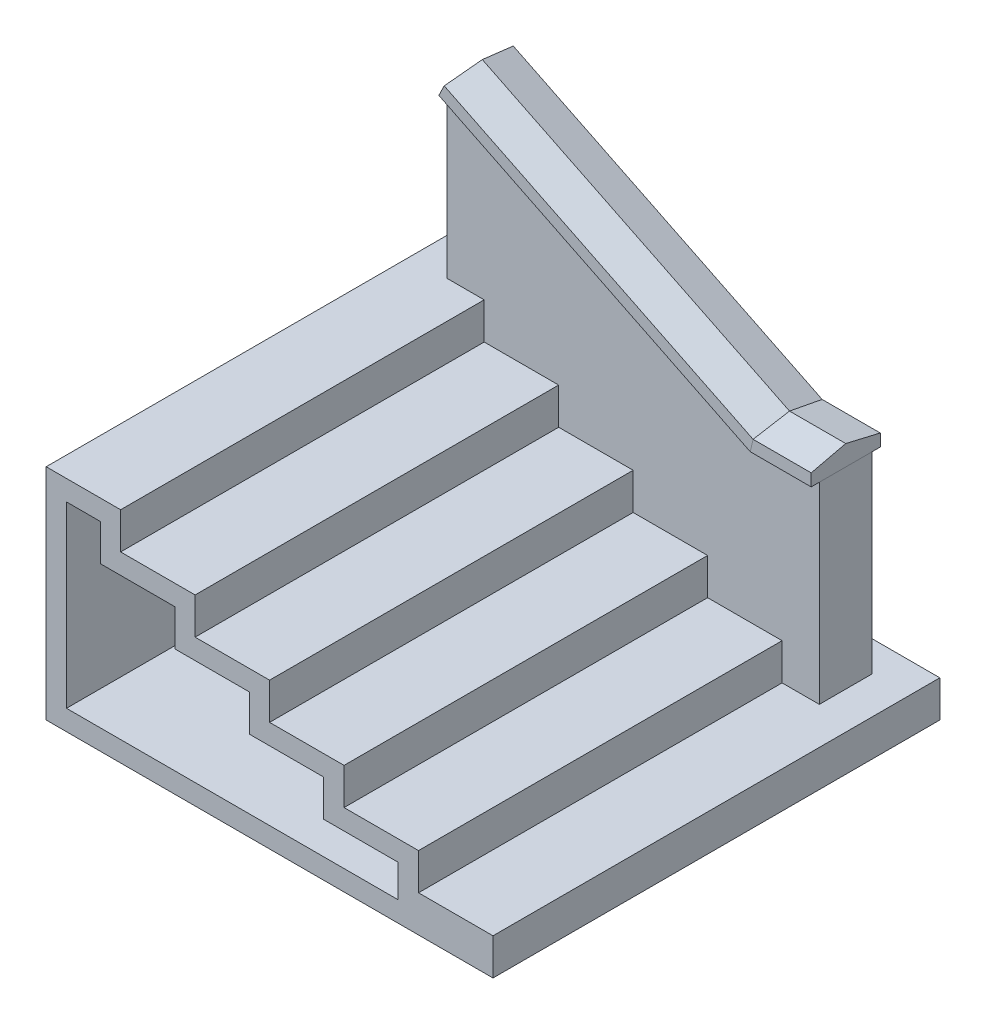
ISO-10303-21;
HEADER;
FILE_DESCRIPTION(('STEP AP214'),'2;1');
FILE_NAME('part.step','',(''),(''),'','','');
FILE_SCHEMA(('AUTOMOTIVE_DESIGN { 1 0 10303 214 1 1 1 1 }'));
ENDSEC;
DATA;
#1=APPLICATION_CONTEXT('core data for automotive mechanical design processes');
#2=APPLICATION_PROTOCOL_DEFINITION('international standard','automotive_design',2000,#1);
#3=PRODUCT_CONTEXT('',#1,'mechanical');
#4=PRODUCT('Part','Part','',(#3));
#5=PRODUCT_RELATED_PRODUCT_CATEGORY('part','',(#4));
#6=PRODUCT_DEFINITION_FORMATION('','',#4);
#7=PRODUCT_DEFINITION_CONTEXT('part definition',#1,'design');
#8=PRODUCT_DEFINITION('design','',#6,#7);
#9=PRODUCT_DEFINITION_SHAPE('','',#8);
#10=(LENGTH_UNIT() NAMED_UNIT(*) SI_UNIT(.MILLI.,.METRE.));
#11=(NAMED_UNIT(*) PLANE_ANGLE_UNIT() SI_UNIT($,.RADIAN.));
#12=(NAMED_UNIT(*) SI_UNIT($,.STERADIAN.) SOLID_ANGLE_UNIT());
#13=UNCERTAINTY_MEASURE_WITH_UNIT(LENGTH_MEASURE(1.E-05),#10,'distance_accuracy_value','');
#14=(GEOMETRIC_REPRESENTATION_CONTEXT(3) GLOBAL_UNCERTAINTY_ASSIGNED_CONTEXT((#13)) GLOBAL_UNIT_ASSIGNED_CONTEXT((#10,
#11,#12)) REPRESENTATION_CONTEXT('',''));
#15=CARTESIAN_POINT('',(0.,0.,0.));
#16=DIRECTION('',(0.,0.,1.));
#17=DIRECTION('',(1.,0.,0.));
#18=AXIS2_PLACEMENT_3D('',#15,#16,#17);
#19=CARTESIAN_POINT('',(128.058333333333,0.,0.));
#20=DIRECTION('',(-1.,0.,0.));
#21=DIRECTION('',(0.,0.,1.));
#22=AXIS2_PLACEMENT_3D('',#19,#20,#21);
#23=PLANE('',#22);
#24=DIRECTION('',(0.,-1.,0.));
#25=VECTOR('',#24,1.);
#26=CARTESIAN_POINT('',(128.058333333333,71.5818181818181,-41.275));
#27=LINE('',#26,#25);
#28=CARTESIAN_POINT('',(128.058333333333,75.3918181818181,-41.275));
#29=VERTEX_POINT('',#28);
#30=CARTESIAN_POINT('',(128.058333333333,71.5818181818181,-41.275));
#31=VERTEX_POINT('',#30);
#32=EDGE_CURVE('E164',#29,#31,#27,.T.);
#33=ORIENTED_EDGE('',*,*,#32,.T.);
#34=DIRECTION('',(0.,0.,-1.));
#35=VECTOR('',#34,1.);
#36=CARTESIAN_POINT('',(128.058333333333,71.5818181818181,-41.275));
#37=LINE('',#36,#35);
#38=CARTESIAN_POINT('',(128.058333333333,71.5818181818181,-62.865));
#39=VERTEX_POINT('',#38);
#40=EDGE_CURVE('E84',#31,#39,#37,.T.);
#41=ORIENTED_EDGE('',*,*,#40,.T.);
#42=DIRECTION('',(0.,1.,0.));
#43=VECTOR('',#42,1.);
#44=CARTESIAN_POINT('',(128.058333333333,71.5818181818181,-62.865));
#45=LINE('',#44,#43);
#46=CARTESIAN_POINT('',(128.058333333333,75.3918181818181,-62.865));
#47=VERTEX_POINT('',#46);
#48=EDGE_CURVE('E80',#39,#47,#45,.T.);
#49=ORIENTED_EDGE('',*,*,#48,.T.);
#50=DIRECTION('',(0.,0.229039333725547,0.973417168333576));
#51=VECTOR('',#50,1.);
#52=CARTESIAN_POINT('',(128.058333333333,75.3918181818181,-62.865));
#53=LINE('',#52,#51);
#54=CARTESIAN_POINT('',(128.058333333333,77.9318181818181,-52.07));
#55=VERTEX_POINT('',#54);
#56=EDGE_CURVE('E170',#47,#55,#53,.T.);
#57=ORIENTED_EDGE('',*,*,#56,.T.);
#58=DIRECTION('',(0.,-0.229039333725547,0.973417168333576));
#59=VECTOR('',#58,1.);
#60=CARTESIAN_POINT('',(128.058333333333,75.3918181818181,-41.275));
#61=LINE('',#60,#59);
#62=EDGE_CURVE('E167',#55,#29,#61,.T.);
#63=ORIENTED_EDGE('',*,*,#62,.T.);
#64=EDGE_LOOP('',(#33,#41,#49,#57,#63));
#65=FACE_BOUND('',#64,.T.);
#66=ADVANCED_FACE('F45',(#65),#23,.F.);
#67=CARTESIAN_POINT('',(-19.9025215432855,55.1233203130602,0.));
#68=DIRECTION('',(-0.897667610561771,0.440673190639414,0.));
#69=DIRECTION('',(0.,0.,1.));
#70=AXIS2_PLACEMENT_3D('',#67,#68,#69);
#71=PLANE('',#70);
#72=DIRECTION('',(-0.440673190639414,-0.897667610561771,0.));
#73=VECTOR('',#72,1.);
#74=CARTESIAN_POINT('',(11.6416666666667,119.38,-41.275));
#75=LINE('',#74,#73);
#76=CARTESIAN_POINT('',(13.3206315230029,122.80011359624,-41.275));
#77=VERTEX_POINT('',#76);
#78=CARTESIAN_POINT('',(11.6416666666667,119.38,-41.275));
#79=VERTEX_POINT('',#78);
#80=EDGE_CURVE('E144',#77,#79,#75,.T.);
#81=ORIENTED_EDGE('',*,*,#80,.F.);
#82=DIRECTION('',(-0.100931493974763,-0.205601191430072,0.973417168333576));
#83=VECTOR('',#82,1.);
#84=CARTESIAN_POINT('',(13.3206315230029,122.80011359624,-41.275));
#85=LINE('',#84,#83);
#86=CARTESIAN_POINT('',(14.439941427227,125.080189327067,-52.07));
#87=VERTEX_POINT('',#86);
#88=EDGE_CURVE('E189',#87,#77,#85,.T.);
#89=ORIENTED_EDGE('',*,*,#88,.F.);
#90=DIRECTION('',(0.100931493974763,0.205601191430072,0.973417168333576));
#91=VECTOR('',#90,1.);
#92=CARTESIAN_POINT('',(13.3206315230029,122.80011359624,-62.865));
#93=LINE('',#92,#91);
#94=CARTESIAN_POINT('',(13.3206315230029,122.80011359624,-62.865));
#95=VERTEX_POINT('',#94);
#96=EDGE_CURVE('E54',#95,#87,#93,.T.);
#97=ORIENTED_EDGE('',*,*,#96,.F.);
#98=DIRECTION('',(0.440673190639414,0.897667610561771,0.));
#99=VECTOR('',#98,1.);
#100=CARTESIAN_POINT('',(11.6416666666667,119.38,-62.865));
#101=LINE('',#100,#99);
#102=CARTESIAN_POINT('',(11.6416666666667,119.38,-62.865));
#103=VERTEX_POINT('',#102);
#104=EDGE_CURVE('E12',#103,#95,#101,.T.);
#105=ORIENTED_EDGE('',*,*,#104,.F.);
#106=DIRECTION('',(0.,0.,-1.));
#107=VECTOR('',#106,1.);
#108=CARTESIAN_POINT('',(11.6416666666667,119.38,-41.275));
#109=LINE('',#108,#107);
#110=EDGE_CURVE('E142',#79,#103,#109,.T.);
#111=ORIENTED_EDGE('',*,*,#110,.F.);
#112=EDGE_LOOP('',(#81,#89,#97,#105,#111));
#113=FACE_BOUND('',#112,.T.);
#114=ADVANCED_FACE('F195',(#113),#71,.T.);
#115=CARTESIAN_POINT('',(109.008333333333,71.5818181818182,-62.865));
#116=DIRECTION('',(0.,0.,-1.));
#117=DIRECTION('',(-1.,0.,0.));
#118=AXIS2_PLACEMENT_3D('',#115,#116,#117);
#119=PLANE('',#118);
#120=DIRECTION('',(-0.226199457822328,-0.974081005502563,0.));
#121=VECTOR('',#120,1.);
#122=CARTESIAN_POINT('',(114.558140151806,95.480909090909,-62.865));
#123=LINE('',#122,#121);
#124=CARTESIAN_POINT('',(109.893085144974,75.3918181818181,-62.865));
#125=VERTEX_POINT('',#124);
#126=CARTESIAN_POINT('',(109.008333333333,71.5818181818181,-62.865));
#127=VERTEX_POINT('',#126);
#128=EDGE_CURVE('E124',#125,#127,#123,.T.);
#129=ORIENTED_EDGE('',*,*,#128,.F.);
#130=DIRECTION('',(1.,0.,0.));
#131=VECTOR('',#130,1.);
#132=CARTESIAN_POINT('',(109.008333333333,75.3918181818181,-62.865));
#133=LINE('',#132,#131);
#134=EDGE_CURVE('E48',#125,#47,#133,.T.);
#135=ORIENTED_EDGE('',*,*,#134,.T.);
#136=ORIENTED_EDGE('',*,*,#48,.F.);
#137=DIRECTION('',(1.,0.,0.));
#138=VECTOR('',#137,1.);
#139=CARTESIAN_POINT('',(109.008333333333,71.5818181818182,-62.865));
#140=LINE('',#139,#138);
#141=EDGE_CURVE('E117',#127,#39,#140,.T.);
#142=ORIENTED_EDGE('',*,*,#141,.F.);
#143=EDGE_LOOP('',(#129,#135,#136,#142));
#144=FACE_BOUND('',#143,.T.);
#145=ADVANCED_FACE('F128',(#144),#119,.T.);
#146=CARTESIAN_POINT('',(109.008333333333,75.3918181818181,-62.865));
#147=DIRECTION('',(0.,0.973417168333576,-0.229039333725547));
#148=DIRECTION('',(0.,0.229039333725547,0.973417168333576));
#149=AXIS2_PLACEMENT_3D('',#146,#147,#148);
#150=PLANE('',#149);
#151=DIRECTION('',(-0.0531120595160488,-0.228716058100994,-0.972043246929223));
#152=VECTOR('',#151,1.);
#153=CARTESIAN_POINT('',(110.196560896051,76.6986735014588,-57.310864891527));
#154=LINE('',#153,#152);
#155=CARTESIAN_POINT('',(110.482919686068,77.9318181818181,-52.07));
#156=VERTEX_POINT('',#155);
#157=EDGE_CURVE('E139',#156,#125,#154,.T.);
#158=ORIENTED_EDGE('',*,*,#157,.F.);
#159=DIRECTION('',(1.,0.,0.));
#160=VECTOR('',#159,1.);
#161=CARTESIAN_POINT('',(109.008333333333,77.9318181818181,-52.07));
#162=LINE('',#161,#160);
#163=EDGE_CURVE('E169',#156,#55,#162,.T.);
#164=ORIENTED_EDGE('',*,*,#163,.T.);
#165=ORIENTED_EDGE('',*,*,#56,.F.);
#166=ORIENTED_EDGE('',*,*,#134,.F.);
#167=EDGE_LOOP('',(#158,#164,#165,#166));
#168=FACE_BOUND('',#167,.T.);
#169=ADVANCED_FACE('F177',(#168),#150,.T.);
#170=CARTESIAN_POINT('',(109.008333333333,75.3918181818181,-41.275));
#171=DIRECTION('',(0.,0.973417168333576,0.229039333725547));
#172=DIRECTION('',(0.,-0.229039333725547,0.973417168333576));
#173=AXIS2_PLACEMENT_3D('',#170,#171,#172);
#174=PLANE('',#173);
#175=DIRECTION('',(0.0531120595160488,0.228716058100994,-0.972043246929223));
#176=VECTOR('',#175,1.);
#177=CARTESIAN_POINT('',(110.196560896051,76.6986735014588,-46.8291351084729));
#178=LINE('',#177,#176);
#179=CARTESIAN_POINT('',(109.893085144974,75.3918181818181,-41.275));
#180=VERTEX_POINT('',#179);
#181=EDGE_CURVE('E152',#180,#156,#178,.T.);
#182=ORIENTED_EDGE('',*,*,#181,.F.);
#183=DIRECTION('',(1.,0.,0.));
#184=VECTOR('',#183,1.);
#185=CARTESIAN_POINT('',(109.008333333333,75.3918181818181,-41.275));
#186=LINE('',#185,#184);
#187=EDGE_CURVE('E166',#180,#29,#186,.T.);
#188=ORIENTED_EDGE('',*,*,#187,.T.);
#189=ORIENTED_EDGE('',*,*,#62,.F.);
#190=ORIENTED_EDGE('',*,*,#163,.F.);
#191=EDGE_LOOP('',(#182,#188,#189,#190));
#192=FACE_BOUND('',#191,.T.);
#193=ADVANCED_FACE('F180',(#192),#174,.T.);
#194=CARTESIAN_POINT('',(109.008333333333,71.5818181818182,-41.275));
#195=DIRECTION('',(0.,0.,1.));
#196=DIRECTION('',(1.,0.,0.));
#197=AXIS2_PLACEMENT_3D('',#194,#195,#196);
#198=PLANE('',#197);
#199=DIRECTION('',(0.226199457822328,0.974081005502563,0.));
#200=VECTOR('',#199,1.);
#201=CARTESIAN_POINT('',(114.558140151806,95.480909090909,-41.275));
#202=LINE('',#201,#200);
#203=CARTESIAN_POINT('',(109.008333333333,71.5818181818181,-41.275));
#204=VERTEX_POINT('',#203);
#205=EDGE_CURVE('E92',#204,#180,#202,.T.);
#206=ORIENTED_EDGE('',*,*,#205,.F.);
#207=DIRECTION('',(1.,0.,0.));
#208=VECTOR('',#207,1.);
#209=CARTESIAN_POINT('',(109.008333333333,71.5818181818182,-41.275));
#210=LINE('',#209,#208);
#211=EDGE_CURVE('E118',#204,#31,#210,.T.);
#212=ORIENTED_EDGE('',*,*,#211,.T.);
#213=ORIENTED_EDGE('',*,*,#32,.F.);
#214=ORIENTED_EDGE('',*,*,#187,.F.);
#215=EDGE_LOOP('',(#206,#212,#213,#214));
#216=FACE_BOUND('',#215,.T.);
#217=ADVANCED_FACE('F212',(#216),#198,.T.);
#218=CARTESIAN_POINT('',(109.008333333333,71.5818181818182,-41.275));
#219=DIRECTION('',(0.,-1.,0.));
#220=DIRECTION('',(1.,0.,0.));
#221=AXIS2_PLACEMENT_3D('',#218,#219,#220);
#222=PLANE('',#221);
#223=ORIENTED_EDGE('',*,*,#40,.F.);
#224=ORIENTED_EDGE('',*,*,#211,.F.);
#225=DIRECTION('',(0.,0.,-1.));
#226=VECTOR('',#225,1.);
#227=CARTESIAN_POINT('',(109.008333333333,71.5818181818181,-41.275));
#228=LINE('',#227,#226);
#229=EDGE_CURVE('E114',#204,#127,#228,.T.);
#230=ORIENTED_EDGE('',*,*,#229,.T.);
#231=ORIENTED_EDGE('',*,*,#141,.T.);
#232=EDGE_LOOP('',(#223,#224,#230,#231));
#233=FACE_BOUND('',#232,.T.);
#234=ADVANCED_FACE('F116',(#233),#222,.T.);
#235=CARTESIAN_POINT('',(11.6416666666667,119.38,-41.275));
#236=DIRECTION('',(-0.440673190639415,-0.89766761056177,0.));
#237=DIRECTION('',(0.89766761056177,-0.440673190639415,0.));
#238=AXIS2_PLACEMENT_3D('',#235,#236,#237);
#239=PLANE('',#238);
#240=ORIENTED_EDGE('',*,*,#229,.F.);
#241=DIRECTION('',(0.89766761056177,-0.440673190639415,0.));
#242=VECTOR('',#241,1.);
#243=CARTESIAN_POINT('',(11.6416666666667,119.38,-41.275));
#244=LINE('',#243,#242);
#245=EDGE_CURVE('E123',#79,#204,#244,.T.);
#246=ORIENTED_EDGE('',*,*,#245,.F.);
#247=ORIENTED_EDGE('',*,*,#110,.T.);
#248=DIRECTION('',(0.89766761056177,-0.440673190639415,0.));
#249=VECTOR('',#248,1.);
#250=CARTESIAN_POINT('',(11.6416666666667,119.38,-62.865));
#251=LINE('',#250,#249);
#252=EDGE_CURVE('E136',#103,#127,#251,.T.);
#253=ORIENTED_EDGE('',*,*,#252,.T.);
#254=EDGE_LOOP('',(#240,#246,#247,#253));
#255=FACE_BOUND('',#254,.T.);
#256=ADVANCED_FACE('F141',(#255),#239,.T.);
#257=CARTESIAN_POINT('',(11.6416666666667,119.38,-62.865));
#258=DIRECTION('',(0.,0.,-1.));
#259=DIRECTION('',(-1.,0.,0.));
#260=AXIS2_PLACEMENT_3D('',#257,#258,#259);
#261=PLANE('',#260);
#262=DIRECTION('',(0.89766761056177,-0.440673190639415,0.));
#263=VECTOR('',#262,1.);
#264=CARTESIAN_POINT('',(13.3206315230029,122.80011359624,-62.865));
#265=LINE('',#264,#263);
#266=EDGE_CURVE('E138',#95,#125,#265,.T.);
#267=ORIENTED_EDGE('',*,*,#266,.T.);
#268=ORIENTED_EDGE('',*,*,#128,.T.);
#269=ORIENTED_EDGE('',*,*,#252,.F.);
#270=ORIENTED_EDGE('',*,*,#104,.T.);
#271=EDGE_LOOP('',(#267,#268,#269,#270));
#272=FACE_BOUND('',#271,.T.);
#273=ADVANCED_FACE('F135',(#272),#261,.T.);
#274=CARTESIAN_POINT('',(13.3206315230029,122.80011359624,-62.865));
#275=DIRECTION('',(0.428958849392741,0.873805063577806,-0.229039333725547));
#276=DIRECTION('',(-0.89766761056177,0.440673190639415,0.));
#277=AXIS2_PLACEMENT_3D('',#274,#275,#276);
#278=PLANE('',#277);
#279=DIRECTION('',(0.89766761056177,-0.440673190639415,0.));
#280=VECTOR('',#279,1.);
#281=CARTESIAN_POINT('',(14.439941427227,125.080189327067,-52.07));
#282=LINE('',#281,#280);
#283=EDGE_CURVE('E146',#87,#156,#282,.T.);
#284=ORIENTED_EDGE('',*,*,#283,.T.);
#285=ORIENTED_EDGE('',*,*,#157,.T.);
#286=ORIENTED_EDGE('',*,*,#266,.F.);
#287=ORIENTED_EDGE('',*,*,#96,.T.);
#288=EDGE_LOOP('',(#284,#285,#286,#287));
#289=FACE_BOUND('',#288,.T.);
#290=ADVANCED_FACE('F188',(#289),#278,.T.);
#291=CARTESIAN_POINT('',(13.3206315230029,122.80011359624,-41.275));
#292=DIRECTION('',(0.428958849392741,0.873805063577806,0.229039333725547));
#293=DIRECTION('',(-0.89766761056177,0.440673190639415,0.));
#294=AXIS2_PLACEMENT_3D('',#291,#292,#293);
#295=PLANE('',#294);
#296=DIRECTION('',(0.89766761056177,-0.440673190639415,0.));
#297=VECTOR('',#296,1.);
#298=CARTESIAN_POINT('',(13.3206315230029,122.80011359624,-41.275));
#299=LINE('',#298,#297);
#300=EDGE_CURVE('E157',#77,#180,#299,.T.);
#301=ORIENTED_EDGE('',*,*,#300,.T.);
#302=ORIENTED_EDGE('',*,*,#181,.T.);
#303=ORIENTED_EDGE('',*,*,#283,.F.);
#304=ORIENTED_EDGE('',*,*,#88,.T.);
#305=EDGE_LOOP('',(#301,#302,#303,#304));
#306=FACE_BOUND('',#305,.T.);
#307=ADVANCED_FACE('F183',(#306),#295,.T.);
#308=CARTESIAN_POINT('',(11.6416666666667,119.38,-41.275));
#309=DIRECTION('',(0.,0.,1.));
#310=DIRECTION('',(1.,0.,0.));
#311=AXIS2_PLACEMENT_3D('',#308,#309,#310);
#312=PLANE('',#311);
#313=ORIENTED_EDGE('',*,*,#245,.T.);
#314=ORIENTED_EDGE('',*,*,#205,.T.);
#315=ORIENTED_EDGE('',*,*,#300,.F.);
#316=ORIENTED_EDGE('',*,*,#80,.T.);
#317=EDGE_LOOP('',(#313,#314,#315,#316));
#318=FACE_BOUND('',#317,.T.);
#319=ADVANCED_FACE('F194',(#318),#312,.T.);
#320=CLOSED_SHELL('',(#66,#114,#145,#169,#193,#217,#234,#256,#273,#290,#307,#319));
#321=MANIFOLD_SOLID_BREP('B2',#320);
#322=CARTESIAN_POINT('',(128.058333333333,11.4299999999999,-43.815));
#323=DIRECTION('',(1.,0.,0.));
#324=DIRECTION('',(0.,0.,-1.));
#325=AXIS2_PLACEMENT_3D('',#322,#323,#324);
#326=PLANE('',#325);
#327=DIRECTION('',(0.,-1.,0.));
#328=VECTOR('',#327,1.);
#329=CARTESIAN_POINT('',(128.058333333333,11.4299999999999,-60.325));
#330=LINE('',#329,#328);
#331=CARTESIAN_POINT('',(128.058333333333,71.5818181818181,-60.325));
#332=VERTEX_POINT('',#331);
#333=CARTESIAN_POINT('',(128.058333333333,11.4299999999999,-60.325));
#334=VERTEX_POINT('',#333);
#335=EDGE_CURVE('E442',#332,#334,#330,.T.);
#336=ORIENTED_EDGE('',*,*,#335,.F.);
#337=DIRECTION('',(0.,0.,-1.));
#338=VECTOR('',#337,1.);
#339=CARTESIAN_POINT('',(128.058333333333,71.5818181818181,-43.815));
#340=LINE('',#339,#338);
#341=CARTESIAN_POINT('',(128.058333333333,71.5818181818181,-43.815));
#342=VERTEX_POINT('',#341);
#343=EDGE_CURVE('E43',#342,#332,#340,.T.);
#344=ORIENTED_EDGE('',*,*,#343,.F.);
#345=DIRECTION('',(0.,-1.,0.));
#346=VECTOR('',#345,1.);
#347=CARTESIAN_POINT('',(128.058333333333,11.4299999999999,-43.815));
#348=LINE('',#347,#346);
#349=CARTESIAN_POINT('',(128.058333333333,11.4299999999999,-43.815));
#350=VERTEX_POINT('',#349);
#351=EDGE_CURVE('E483',#342,#350,#348,.T.);
#352=ORIENTED_EDGE('',*,*,#351,.T.);
#353=DIRECTION('',(0.,0.,-1.));
#354=VECTOR('',#353,1.);
#355=CARTESIAN_POINT('',(128.058333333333,11.4299999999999,-43.815));
#356=LINE('',#355,#354);
#357=EDGE_CURVE('E306',#350,#334,#356,.T.);
#358=ORIENTED_EDGE('',*,*,#357,.T.);
#359=EDGE_LOOP('',(#336,#344,#352,#358));
#360=FACE_BOUND('',#359,.T.);
#361=ADVANCED_FACE('F303',(#360),#326,.T.);
#362=CARTESIAN_POINT('',(109.008333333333,71.5818181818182,-43.815));
#363=DIRECTION('',(0.,1.,0.));
#364=DIRECTION('',(-1.,0.,0.));
#365=AXIS2_PLACEMENT_3D('',#362,#363,#364);
#366=PLANE('',#365);
#367=DIRECTION('',(1.,0.,0.));
#368=VECTOR('',#367,1.);
#369=CARTESIAN_POINT('',(109.008333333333,71.5818181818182,-60.325));
#370=LINE('',#369,#368);
#371=CARTESIAN_POINT('',(109.008333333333,71.5818181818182,-60.325));
#372=VERTEX_POINT('',#371);
#373=EDGE_CURVE('E481',#372,#332,#370,.T.);
#374=ORIENTED_EDGE('',*,*,#373,.F.);
#375=DIRECTION('',(0.,0.,-1.));
#376=VECTOR('',#375,1.);
#377=CARTESIAN_POINT('',(109.008333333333,71.5818181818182,-43.815));
#378=LINE('',#377,#376);
#379=CARTESIAN_POINT('',(109.008333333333,71.5818181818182,-43.815));
#380=VERTEX_POINT('',#379);
#381=EDGE_CURVE('E312',#380,#372,#378,.T.);
#382=ORIENTED_EDGE('',*,*,#381,.F.);
#383=DIRECTION('',(1.,0.,0.));
#384=VECTOR('',#383,1.);
#385=CARTESIAN_POINT('',(109.008333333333,71.5818181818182,-43.815));
#386=LINE('',#385,#384);
#387=EDGE_CURVE('E432',#380,#342,#386,.T.);
#388=ORIENTED_EDGE('',*,*,#387,.T.);
#389=ORIENTED_EDGE('',*,*,#343,.T.);
#390=EDGE_LOOP('',(#374,#382,#388,#389));
#391=FACE_BOUND('',#390,.T.);
#392=ADVANCED_FACE('F509',(#391),#366,.T.);
#393=CARTESIAN_POINT('',(11.6416666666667,119.38,-43.815));
#394=DIRECTION('',(0.440673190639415,0.89766761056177,0.));
#395=DIRECTION('',(-0.89766761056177,0.440673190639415,0.));
#396=AXIS2_PLACEMENT_3D('',#393,#394,#395);
#397=PLANE('',#396);
#398=DIRECTION('',(0.89766761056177,-0.440673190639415,0.));
#399=VECTOR('',#398,1.);
#400=CARTESIAN_POINT('',(11.6416666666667,119.38,-60.325));
#401=LINE('',#400,#399);
#402=CARTESIAN_POINT('',(11.6416666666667,119.38,-60.325));
#403=VERTEX_POINT('',#402);
#404=EDGE_CURVE('E419',#403,#372,#401,.T.);
#405=ORIENTED_EDGE('',*,*,#404,.F.);
#406=DIRECTION('',(0.,0.,-1.));
#407=VECTOR('',#406,1.);
#408=CARTESIAN_POINT('',(11.6416666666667,119.38,-43.815));
#409=LINE('',#408,#407);
#410=CARTESIAN_POINT('',(11.6416666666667,119.38,-43.815));
#411=VERTEX_POINT('',#410);
#412=EDGE_CURVE('E414',#411,#403,#409,.T.);
#413=ORIENTED_EDGE('',*,*,#412,.F.);
#414=DIRECTION('',(0.89766761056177,-0.440673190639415,0.));
#415=VECTOR('',#414,1.);
#416=CARTESIAN_POINT('',(11.6416666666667,119.38,-43.815));
#417=LINE('',#416,#415);
#418=EDGE_CURVE('E417',#411,#380,#417,.T.);
#419=ORIENTED_EDGE('',*,*,#418,.T.);
#420=ORIENTED_EDGE('',*,*,#381,.T.);
#421=EDGE_LOOP('',(#405,#413,#419,#420));
#422=FACE_BOUND('',#421,.T.);
#423=ADVANCED_FACE('F416',(#422),#397,.T.);
#424=CARTESIAN_POINT('',(11.6416666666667,68.58,-43.815));
#425=DIRECTION('',(-1.,0.,0.));
#426=DIRECTION('',(0.,-1.,0.));
#427=AXIS2_PLACEMENT_3D('',#424,#425,#426);
#428=PLANE('',#427);
#429=DIRECTION('',(0.,1.,0.));
#430=VECTOR('',#429,1.);
#431=CARTESIAN_POINT('',(11.6416666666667,68.58,-60.325));
#432=LINE('',#431,#430);
#433=CARTESIAN_POINT('',(11.6416666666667,68.58,-60.325));
#434=VERTEX_POINT('',#433);
#435=EDGE_CURVE('E478',#434,#403,#432,.T.);
#436=ORIENTED_EDGE('',*,*,#435,.F.);
#437=DIRECTION('',(0.,0.,-1.));
#438=VECTOR('',#437,1.);
#439=CARTESIAN_POINT('',(11.6416666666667,68.58,-43.815));
#440=LINE('',#439,#438);
#441=CARTESIAN_POINT('',(11.6416666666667,68.58,-43.815));
#442=VERTEX_POINT('',#441);
#443=EDGE_CURVE('E424',#442,#434,#440,.T.);
#444=ORIENTED_EDGE('',*,*,#443,.F.);
#445=DIRECTION('',(0.,1.,0.));
#446=VECTOR('',#445,1.);
#447=CARTESIAN_POINT('',(11.6416666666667,68.58,-43.815));
#448=LINE('',#447,#446);
#449=EDGE_CURVE('E430',#442,#411,#448,.T.);
#450=ORIENTED_EDGE('',*,*,#449,.T.);
#451=ORIENTED_EDGE('',*,*,#412,.T.);
#452=EDGE_LOOP('',(#436,#444,#450,#451));
#453=FACE_BOUND('',#452,.T.);
#454=ADVANCED_FACE('F434',(#453),#428,.T.);
#455=CARTESIAN_POINT('',(23.2833333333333,68.58,-43.815));
#456=DIRECTION('',(0.,-1.,0.));
#457=DIRECTION('',(1.,0.,0.));
#458=AXIS2_PLACEMENT_3D('',#455,#456,#457);
#459=PLANE('',#458);
#460=DIRECTION('',(-1.,0.,0.));
#461=VECTOR('',#460,1.);
#462=CARTESIAN_POINT('',(23.2833333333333,68.58,-60.325));
#463=LINE('',#462,#461);
#464=CARTESIAN_POINT('',(23.2833333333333,68.58,-60.325));
#465=VERTEX_POINT('',#464);
#466=EDGE_CURVE('E475',#465,#434,#463,.T.);
#467=ORIENTED_EDGE('',*,*,#466,.F.);
#468=DIRECTION('',(0.,0.,-1.));
#469=VECTOR('',#468,1.);
#470=CARTESIAN_POINT('',(23.2833333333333,68.58,-43.815));
#471=LINE('',#470,#469);
#472=CARTESIAN_POINT('',(23.2833333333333,68.58,-43.815));
#473=VERTEX_POINT('',#472);
#474=EDGE_CURVE('E487',#473,#465,#471,.T.);
#475=ORIENTED_EDGE('',*,*,#474,.F.);
#476=DIRECTION('',(-1.,0.,0.));
#477=VECTOR('',#476,1.);
#478=CARTESIAN_POINT('',(23.2833333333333,68.58,-43.815));
#479=LINE('',#478,#477);
#480=EDGE_CURVE('E435',#473,#442,#479,.T.);
#481=ORIENTED_EDGE('',*,*,#480,.T.);
#482=ORIENTED_EDGE('',*,*,#443,.T.);
#483=EDGE_LOOP('',(#467,#475,#481,#482));
#484=FACE_BOUND('',#483,.T.);
#485=ADVANCED_FACE('F522',(#484),#459,.T.);
#486=CARTESIAN_POINT('',(23.2833333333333,57.15,-43.815));
#487=DIRECTION('',(-1.,0.,0.));
#488=DIRECTION('',(0.,0.,1.));
#489=AXIS2_PLACEMENT_3D('',#486,#487,#488);
#490=PLANE('',#489);
#491=DIRECTION('',(0.,1.,0.));
#492=VECTOR('',#491,1.);
#493=CARTESIAN_POINT('',(23.2833333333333,57.15,-60.325));
#494=LINE('',#493,#492);
#495=CARTESIAN_POINT('',(23.2833333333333,57.15,-60.325));
#496=VERTEX_POINT('',#495);
#497=EDGE_CURVE('E472',#496,#465,#494,.T.);
#498=ORIENTED_EDGE('',*,*,#497,.F.);
#499=DIRECTION('',(0.,0.,-1.));
#500=VECTOR('',#499,1.);
#501=CARTESIAN_POINT('',(23.2833333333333,57.15,-43.815));
#502=LINE('',#501,#500);
#503=CARTESIAN_POINT('',(23.2833333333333,57.15,-43.815));
#504=VERTEX_POINT('',#503);
#505=EDGE_CURVE('E489',#504,#496,#502,.T.);
#506=ORIENTED_EDGE('',*,*,#505,.F.);
#507=DIRECTION('',(0.,1.,0.));
#508=VECTOR('',#507,1.);
#509=CARTESIAN_POINT('',(23.2833333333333,57.15,-43.815));
#510=LINE('',#509,#508);
#511=EDGE_CURVE('E437',#504,#473,#510,.T.);
#512=ORIENTED_EDGE('',*,*,#511,.T.);
#513=ORIENTED_EDGE('',*,*,#474,.T.);
#514=EDGE_LOOP('',(#498,#506,#512,#513));
#515=FACE_BOUND('',#514,.T.);
#516=ADVANCED_FACE('F525',(#515),#490,.T.);
#517=CARTESIAN_POINT('',(46.5666666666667,57.15,-43.815));
#518=DIRECTION('',(0.,-1.,0.));
#519=DIRECTION('',(0.,0.,-1.));
#520=AXIS2_PLACEMENT_3D('',#517,#518,#519);
#521=PLANE('',#520);
#522=DIRECTION('',(-1.,0.,0.));
#523=VECTOR('',#522,1.);
#524=CARTESIAN_POINT('',(46.5666666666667,57.15,-60.325));
#525=LINE('',#524,#523);
#526=CARTESIAN_POINT('',(46.5666666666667,57.15,-60.325));
#527=VERTEX_POINT('',#526);
#528=EDGE_CURVE('E469',#527,#496,#525,.T.);
#529=ORIENTED_EDGE('',*,*,#528,.F.);
#530=DIRECTION('',(0.,0.,-1.));
#531=VECTOR('',#530,1.);
#532=CARTESIAN_POINT('',(46.5666666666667,57.15,-43.815));
#533=LINE('',#532,#531);
#534=CARTESIAN_POINT('',(46.5666666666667,57.15,-43.815));
#535=VERTEX_POINT('',#534);
#536=EDGE_CURVE('E491',#535,#527,#533,.T.);
#537=ORIENTED_EDGE('',*,*,#536,.F.);
#538=DIRECTION('',(-1.,0.,0.));
#539=VECTOR('',#538,1.);
#540=CARTESIAN_POINT('',(46.5666666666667,57.15,-43.815));
#541=LINE('',#540,#539);
#542=EDGE_CURVE('E711',#535,#504,#541,.T.);
#543=ORIENTED_EDGE('',*,*,#542,.T.);
#544=ORIENTED_EDGE('',*,*,#505,.T.);
#545=EDGE_LOOP('',(#529,#537,#543,#544));
#546=FACE_BOUND('',#545,.T.);
#547=ADVANCED_FACE('F529',(#546),#521,.T.);
#548=CARTESIAN_POINT('',(46.5666666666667,45.72,-43.815));
#549=DIRECTION('',(-1.,0.,0.));
#550=DIRECTION('',(0.,0.,1.));
#551=AXIS2_PLACEMENT_3D('',#548,#549,#550);
#552=PLANE('',#551);
#553=DIRECTION('',(0.,1.,0.));
#554=VECTOR('',#553,1.);
#555=CARTESIAN_POINT('',(46.5666666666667,45.72,-60.325));
#556=LINE('',#555,#554);
#557=CARTESIAN_POINT('',(46.5666666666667,45.72,-60.325));
#558=VERTEX_POINT('',#557);
#559=EDGE_CURVE('E466',#558,#527,#556,.T.);
#560=ORIENTED_EDGE('',*,*,#559,.F.);
#561=DIRECTION('',(0.,0.,-1.));
#562=VECTOR('',#561,1.);
#563=CARTESIAN_POINT('',(46.5666666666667,45.72,-43.815));
#564=LINE('',#563,#562);
#565=CARTESIAN_POINT('',(46.5666666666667,45.72,-43.815));
#566=VERTEX_POINT('',#565);
#567=EDGE_CURVE('E493',#566,#558,#564,.T.);
#568=ORIENTED_EDGE('',*,*,#567,.F.);
#569=DIRECTION('',(0.,1.,0.));
#570=VECTOR('',#569,1.);
#571=CARTESIAN_POINT('',(46.5666666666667,45.72,-43.815));
#572=LINE('',#571,#570);
#573=EDGE_CURVE('E715',#566,#535,#572,.T.);
#574=ORIENTED_EDGE('',*,*,#573,.T.);
#575=ORIENTED_EDGE('',*,*,#536,.T.);
#576=EDGE_LOOP('',(#560,#568,#574,#575));
#577=FACE_BOUND('',#576,.T.);
#578=ADVANCED_FACE('F533',(#577),#552,.T.);
#579=CARTESIAN_POINT('',(69.85,45.72,-43.815));
#580=DIRECTION('',(0.,-1.,0.));
#581=DIRECTION('',(0.,0.,-1.));
#582=AXIS2_PLACEMENT_3D('',#579,#580,#581);
#583=PLANE('',#582);
#584=DIRECTION('',(-1.,0.,0.));
#585=VECTOR('',#584,1.);
#586=CARTESIAN_POINT('',(69.85,45.72,-60.325));
#587=LINE('',#586,#585);
#588=CARTESIAN_POINT('',(69.85,45.72,-60.325));
#589=VERTEX_POINT('',#588);
#590=EDGE_CURVE('E463',#589,#558,#587,.T.);
#591=ORIENTED_EDGE('',*,*,#590,.F.);
#592=DIRECTION('',(0.,0.,-1.));
#593=VECTOR('',#592,1.);
#594=CARTESIAN_POINT('',(69.85,45.72,-43.815));
#595=LINE('',#594,#593);
#596=CARTESIAN_POINT('',(69.85,45.72,-43.815));
#597=VERTEX_POINT('',#596);
#598=EDGE_CURVE('E495',#597,#589,#595,.T.);
#599=ORIENTED_EDGE('',*,*,#598,.F.);
#600=DIRECTION('',(-1.,0.,0.));
#601=VECTOR('',#600,1.);
#602=CARTESIAN_POINT('',(69.85,45.72,-43.815));
#603=LINE('',#602,#601);
#604=EDGE_CURVE('E704',#597,#566,#603,.T.);
#605=ORIENTED_EDGE('',*,*,#604,.T.);
#606=ORIENTED_EDGE('',*,*,#567,.T.);
#607=EDGE_LOOP('',(#591,#599,#605,#606));
#608=FACE_BOUND('',#607,.T.);
#609=ADVANCED_FACE('F537',(#608),#583,.T.);
#610=CARTESIAN_POINT('',(69.85,34.29,-43.815));
#611=DIRECTION('',(-1.,0.,0.));
#612=DIRECTION('',(0.,0.,1.));
#613=AXIS2_PLACEMENT_3D('',#610,#611,#612);
#614=PLANE('',#613);
#615=DIRECTION('',(0.,1.,0.));
#616=VECTOR('',#615,1.);
#617=CARTESIAN_POINT('',(69.85,34.29,-60.325));
#618=LINE('',#617,#616);
#619=CARTESIAN_POINT('',(69.85,34.29,-60.325));
#620=VERTEX_POINT('',#619);
#621=EDGE_CURVE('E460',#620,#589,#618,.T.);
#622=ORIENTED_EDGE('',*,*,#621,.F.);
#623=DIRECTION('',(0.,0.,-1.));
#624=VECTOR('',#623,1.);
#625=CARTESIAN_POINT('',(69.85,34.29,-43.815));
#626=LINE('',#625,#624);
#627=CARTESIAN_POINT('',(69.85,34.29,-43.815));
#628=VERTEX_POINT('',#627);
#629=EDGE_CURVE('E497',#628,#620,#626,.T.);
#630=ORIENTED_EDGE('',*,*,#629,.F.);
#631=DIRECTION('',(0.,1.,0.));
#632=VECTOR('',#631,1.);
#633=CARTESIAN_POINT('',(69.85,34.29,-43.815));
#634=LINE('',#633,#632);
#635=EDGE_CURVE('E700',#628,#597,#634,.T.);
#636=ORIENTED_EDGE('',*,*,#635,.T.);
#637=ORIENTED_EDGE('',*,*,#598,.T.);
#638=EDGE_LOOP('',(#622,#630,#636,#637));
#639=FACE_BOUND('',#638,.T.);
#640=ADVANCED_FACE('F541',(#639),#614,.T.);
#641=CARTESIAN_POINT('',(93.1333333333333,34.29,-43.815));
#642=DIRECTION('',(0.,-1.,0.));
#643=DIRECTION('',(0.,0.,-1.));
#644=AXIS2_PLACEMENT_3D('',#641,#642,#643);
#645=PLANE('',#644);
#646=DIRECTION('',(-1.,0.,0.));
#647=VECTOR('',#646,1.);
#648=CARTESIAN_POINT('',(93.1333333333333,34.29,-60.325));
#649=LINE('',#648,#647);
#650=CARTESIAN_POINT('',(93.1333333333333,34.29,-60.325));
#651=VERTEX_POINT('',#650);
#652=EDGE_CURVE('E457',#651,#620,#649,.T.);
#653=ORIENTED_EDGE('',*,*,#652,.F.);
#654=DIRECTION('',(0.,0.,-1.));
#655=VECTOR('',#654,1.);
#656=CARTESIAN_POINT('',(93.1333333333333,34.29,-43.815));
#657=LINE('',#656,#655);
#658=CARTESIAN_POINT('',(93.1333333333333,34.29,-43.815));
#659=VERTEX_POINT('',#658);
#660=EDGE_CURVE('E499',#659,#651,#657,.T.);
#661=ORIENTED_EDGE('',*,*,#660,.F.);
#662=DIRECTION('',(-1.,0.,0.));
#663=VECTOR('',#662,1.);
#664=CARTESIAN_POINT('',(93.1333333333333,34.29,-43.815));
#665=LINE('',#664,#663);
#666=EDGE_CURVE('E721',#659,#628,#665,.T.);
#667=ORIENTED_EDGE('',*,*,#666,.T.);
#668=ORIENTED_EDGE('',*,*,#629,.T.);
#669=EDGE_LOOP('',(#653,#661,#667,#668));
#670=FACE_BOUND('',#669,.T.);
#671=ADVANCED_FACE('F545',(#670),#645,.T.);
#672=CARTESIAN_POINT('',(93.1333333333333,22.86,-43.815));
#673=DIRECTION('',(-1.,0.,0.));
#674=DIRECTION('',(0.,0.,1.));
#675=AXIS2_PLACEMENT_3D('',#672,#673,#674);
#676=PLANE('',#675);
#677=DIRECTION('',(0.,1.,0.));
#678=VECTOR('',#677,1.);
#679=CARTESIAN_POINT('',(93.1333333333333,22.86,-60.325));
#680=LINE('',#679,#678);
#681=CARTESIAN_POINT('',(93.1333333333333,22.86,-60.325));
#682=VERTEX_POINT('',#681);
#683=EDGE_CURVE('E454',#682,#651,#680,.T.);
#684=ORIENTED_EDGE('',*,*,#683,.F.);
#685=DIRECTION('',(0.,0.,-1.));
#686=VECTOR('',#685,1.);
#687=CARTESIAN_POINT('',(93.1333333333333,22.86,-43.815));
#688=LINE('',#687,#686);
#689=CARTESIAN_POINT('',(93.1333333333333,22.86,-43.815));
#690=VERTEX_POINT('',#689);
#691=EDGE_CURVE('E501',#690,#682,#688,.T.);
#692=ORIENTED_EDGE('',*,*,#691,.F.);
#693=DIRECTION('',(0.,1.,0.));
#694=VECTOR('',#693,1.);
#695=CARTESIAN_POINT('',(93.1333333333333,22.86,-43.815));
#696=LINE('',#695,#694);
#697=EDGE_CURVE('E693',#690,#659,#696,.T.);
#698=ORIENTED_EDGE('',*,*,#697,.T.);
#699=ORIENTED_EDGE('',*,*,#660,.T.);
#700=EDGE_LOOP('',(#684,#692,#698,#699));
#701=FACE_BOUND('',#700,.T.);
#702=ADVANCED_FACE('F549',(#701),#676,.T.);
#703=CARTESIAN_POINT('',(116.416666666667,22.86,-43.815));
#704=DIRECTION('',(0.,-1.,0.));
#705=DIRECTION('',(0.,0.,-1.));
#706=AXIS2_PLACEMENT_3D('',#703,#704,#705);
#707=PLANE('',#706);
#708=DIRECTION('',(-1.,0.,0.));
#709=VECTOR('',#708,1.);
#710=CARTESIAN_POINT('',(116.416666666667,22.86,-60.325));
#711=LINE('',#710,#709);
#712=CARTESIAN_POINT('',(116.416666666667,22.86,-60.325));
#713=VERTEX_POINT('',#712);
#714=EDGE_CURVE('E451',#713,#682,#711,.T.);
#715=ORIENTED_EDGE('',*,*,#714,.F.);
#716=DIRECTION('',(0.,0.,-1.));
#717=VECTOR('',#716,1.);
#718=CARTESIAN_POINT('',(116.416666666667,22.86,-43.815));
#719=LINE('',#718,#717);
#720=CARTESIAN_POINT('',(116.416666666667,22.86,-43.815));
#721=VERTEX_POINT('',#720);
#722=EDGE_CURVE('E503',#721,#713,#719,.T.);
#723=ORIENTED_EDGE('',*,*,#722,.F.);
#724=DIRECTION('',(-1.,0.,0.));
#725=VECTOR('',#724,1.);
#726=CARTESIAN_POINT('',(116.416666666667,22.86,-43.815));
#727=LINE('',#726,#725);
#728=EDGE_CURVE('E689',#721,#690,#727,.T.);
#729=ORIENTED_EDGE('',*,*,#728,.T.);
#730=ORIENTED_EDGE('',*,*,#691,.T.);
#731=EDGE_LOOP('',(#715,#723,#729,#730));
#732=FACE_BOUND('',#731,.T.);
#733=ADVANCED_FACE('F553',(#732),#707,.T.);
#734=CARTESIAN_POINT('',(116.416666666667,11.43,-43.815));
#735=DIRECTION('',(-1.,0.,0.));
#736=DIRECTION('',(0.,0.,1.));
#737=AXIS2_PLACEMENT_3D('',#734,#735,#736);
#738=PLANE('',#737);
#739=DIRECTION('',(0.,1.,0.));
#740=VECTOR('',#739,1.);
#741=CARTESIAN_POINT('',(116.416666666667,11.43,-60.325));
#742=LINE('',#741,#740);
#743=CARTESIAN_POINT('',(116.416666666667,11.43,-60.325));
#744=VERTEX_POINT('',#743);
#745=EDGE_CURVE('E448',#744,#713,#742,.T.);
#746=ORIENTED_EDGE('',*,*,#745,.F.);
#747=DIRECTION('',(0.,0.,-1.));
#748=VECTOR('',#747,1.);
#749=CARTESIAN_POINT('',(116.416666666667,11.43,-43.815));
#750=LINE('',#749,#748);
#751=CARTESIAN_POINT('',(116.416666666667,11.43,-43.815));
#752=VERTEX_POINT('',#751);
#753=EDGE_CURVE('E504',#752,#744,#750,.T.);
#754=ORIENTED_EDGE('',*,*,#753,.F.);
#755=DIRECTION('',(0.,1.,0.));
#756=VECTOR('',#755,1.);
#757=CARTESIAN_POINT('',(116.416666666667,11.43,-43.815));
#758=LINE('',#757,#756);
#759=EDGE_CURVE('E725',#752,#721,#758,.T.);
#760=ORIENTED_EDGE('',*,*,#759,.T.);
#761=ORIENTED_EDGE('',*,*,#722,.T.);
#762=EDGE_LOOP('',(#746,#754,#760,#761));
#763=FACE_BOUND('',#762,.T.);
#764=ADVANCED_FACE('F557',(#763),#738,.T.);
#765=CARTESIAN_POINT('',(128.058333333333,11.4299999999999,-43.815));
#766=DIRECTION('',(0.,-1.,0.));
#767=DIRECTION('',(1.,0.,0.));
#768=AXIS2_PLACEMENT_3D('',#765,#766,#767);
#769=PLANE('',#768);
#770=DIRECTION('',(-1.,0.,0.));
#771=VECTOR('',#770,1.);
#772=CARTESIAN_POINT('',(128.058333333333,11.4299999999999,-60.325));
#773=LINE('',#772,#771);
#774=EDGE_CURVE('E445',#334,#744,#773,.T.);
#775=ORIENTED_EDGE('',*,*,#774,.F.);
#776=ORIENTED_EDGE('',*,*,#357,.F.);
#777=DIRECTION('',(-1.,0.,0.));
#778=VECTOR('',#777,1.);
#779=CARTESIAN_POINT('',(128.058333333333,11.4299999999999,-43.815));
#780=LINE('',#779,#778);
#781=EDGE_CURVE('E727',#350,#752,#780,.T.);
#782=ORIENTED_EDGE('',*,*,#781,.T.);
#783=ORIENTED_EDGE('',*,*,#753,.T.);
#784=EDGE_LOOP('',(#775,#776,#782,#783));
#785=FACE_BOUND('',#784,.T.);
#786=ADVANCED_FACE('F506',(#785),#769,.T.);
#787=CARTESIAN_POINT('',(0.,0.,-43.815));
#788=DIRECTION('',(0.,0.,-1.));
#789=DIRECTION('',(-1.,0.,0.));
#790=AXIS2_PLACEMENT_3D('',#787,#788,#789);
#791=PLANE('',#790);
#792=ORIENTED_EDGE('',*,*,#351,.F.);
#793=ORIENTED_EDGE('',*,*,#387,.F.);
#794=ORIENTED_EDGE('',*,*,#418,.F.);
#795=ORIENTED_EDGE('',*,*,#449,.F.);
#796=ORIENTED_EDGE('',*,*,#480,.F.);
#797=ORIENTED_EDGE('',*,*,#511,.F.);
#798=ORIENTED_EDGE('',*,*,#542,.F.);
#799=ORIENTED_EDGE('',*,*,#573,.F.);
#800=ORIENTED_EDGE('',*,*,#604,.F.);
#801=ORIENTED_EDGE('',*,*,#635,.F.);
#802=ORIENTED_EDGE('',*,*,#666,.F.);
#803=ORIENTED_EDGE('',*,*,#697,.F.);
#804=ORIENTED_EDGE('',*,*,#728,.F.);
#805=ORIENTED_EDGE('',*,*,#759,.F.);
#806=ORIENTED_EDGE('',*,*,#781,.F.);
#807=EDGE_LOOP('',(#792,#793,#794,#795,#796,#797,#798,#799,#800,#801,#802,#803,#804,#805,#806));
#808=FACE_BOUND('',#807,.T.);
#809=ADVANCED_FACE('F428',(#808),#791,.F.);
#810=CARTESIAN_POINT('',(0.,0.,-60.325));
#811=DIRECTION('',(0.,0.,-1.));
#812=DIRECTION('',(-1.,0.,0.));
#813=AXIS2_PLACEMENT_3D('',#810,#811,#812);
#814=PLANE('',#813);
#815=ORIENTED_EDGE('',*,*,#335,.T.);
#816=ORIENTED_EDGE('',*,*,#774,.T.);
#817=ORIENTED_EDGE('',*,*,#745,.T.);
#818=ORIENTED_EDGE('',*,*,#714,.T.);
#819=ORIENTED_EDGE('',*,*,#683,.T.);
#820=ORIENTED_EDGE('',*,*,#652,.T.);
#821=ORIENTED_EDGE('',*,*,#621,.T.);
#822=ORIENTED_EDGE('',*,*,#590,.T.);
#823=ORIENTED_EDGE('',*,*,#559,.T.);
#824=ORIENTED_EDGE('',*,*,#528,.T.);
#825=ORIENTED_EDGE('',*,*,#497,.T.);
#826=ORIENTED_EDGE('',*,*,#466,.T.);
#827=ORIENTED_EDGE('',*,*,#435,.T.);
#828=ORIENTED_EDGE('',*,*,#404,.T.);
#829=ORIENTED_EDGE('',*,*,#373,.T.);
#830=EDGE_LOOP('',(#815,#816,#817,#818,#819,#820,#821,#822,#823,#824,#825,#826,#827,#828,#829));
#831=FACE_BOUND('',#830,.T.);
#832=ADVANCED_FACE('F508',(#831),#814,.T.);
#833=CLOSED_SHELL('',(#361,#392,#423,#454,#485,#516,#547,#578,#609,#640,#671,#702,#733,#764,
#786,#809,#832));
#834=MANIFOLD_SOLID_BREP('B6',#833);
#835=CARTESIAN_POINT('',(0.,0.,69.85));
#836=DIRECTION('',(0.,0.,-1.));
#837=DIRECTION('',(-1.,0.,0.));
#838=AXIS2_PLACEMENT_3D('',#835,#836,#837);
#839=PLANE('',#838);
#840=DIRECTION('',(-1.,0.,0.));
#841=VECTOR('',#840,1.);
#842=CARTESIAN_POINT('',(0.,68.58,69.85));
#843=LINE('',#842,#841);
#844=CARTESIAN_POINT('',(23.2833333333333,68.58,69.85));
#845=VERTEX_POINT('',#844);
#846=CARTESIAN_POINT('',(0.,68.58,69.85));
#847=VERTEX_POINT('',#846);
#848=EDGE_CURVE('E983',#845,#847,#843,.T.);
#849=ORIENTED_EDGE('',*,*,#848,.T.);
#850=DIRECTION('',(0.,-1.,0.));
#851=VECTOR('',#850,1.);
#852=CARTESIAN_POINT('',(0.,0.,69.85));
#853=LINE('',#852,#851);
#854=CARTESIAN_POINT('',(0.,0.,69.85));
#855=VERTEX_POINT('',#854);
#856=EDGE_CURVE('E986',#847,#855,#853,.T.);
#857=ORIENTED_EDGE('',*,*,#856,.T.);
#858=DIRECTION('',(1.,0.,0.));
#859=VECTOR('',#858,1.);
#860=CARTESIAN_POINT('',(139.7,0.,69.85));
#861=LINE('',#860,#859);
#862=CARTESIAN_POINT('',(139.7,0.,69.85));
#863=VERTEX_POINT('',#862);
#864=EDGE_CURVE('E989',#855,#863,#861,.T.);
#865=ORIENTED_EDGE('',*,*,#864,.T.);
#866=DIRECTION('',(0.,1.,0.));
#867=VECTOR('',#866,1.);
#868=CARTESIAN_POINT('',(139.7,11.4299999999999,69.85));
#869=LINE('',#868,#867);
#870=CARTESIAN_POINT('',(139.7,11.4299999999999,69.85));
#871=VERTEX_POINT('',#870);
#872=EDGE_CURVE('E991',#863,#871,#869,.T.);
#873=ORIENTED_EDGE('',*,*,#872,.T.);
#874=DIRECTION('',(-1.,0.,0.));
#875=VECTOR('',#874,1.);
#876=CARTESIAN_POINT('',(116.416666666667,11.43,69.85));
#877=LINE('',#876,#875);
#878=CARTESIAN_POINT('',(116.416666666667,11.43,69.85));
#879=VERTEX_POINT('',#878);
#880=EDGE_CURVE('E993',#871,#879,#877,.T.);
#881=ORIENTED_EDGE('',*,*,#880,.T.);
#882=DIRECTION('',(0.,1.,0.));
#883=VECTOR('',#882,1.);
#884=CARTESIAN_POINT('',(116.416666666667,22.86,69.85));
#885=LINE('',#884,#883);
#886=CARTESIAN_POINT('',(116.416666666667,22.86,69.85));
#887=VERTEX_POINT('',#886);
#888=EDGE_CURVE('E995',#879,#887,#885,.T.);
#889=ORIENTED_EDGE('',*,*,#888,.T.);
#890=DIRECTION('',(-1.,0.,0.));
#891=VECTOR('',#890,1.);
#892=CARTESIAN_POINT('',(93.1333333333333,22.86,69.85));
#893=LINE('',#892,#891);
#894=CARTESIAN_POINT('',(93.1333333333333,22.86,69.85));
#895=VERTEX_POINT('',#894);
#896=EDGE_CURVE('E997',#887,#895,#893,.T.);
#897=ORIENTED_EDGE('',*,*,#896,.T.);
#898=DIRECTION('',(0.,1.,0.));
#899=VECTOR('',#898,1.);
#900=CARTESIAN_POINT('',(93.1333333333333,34.29,69.85));
#901=LINE('',#900,#899);
#902=CARTESIAN_POINT('',(93.1333333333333,34.29,69.85));
#903=VERTEX_POINT('',#902);
#904=EDGE_CURVE('E999',#895,#903,#901,.T.);
#905=ORIENTED_EDGE('',*,*,#904,.T.);
#906=DIRECTION('',(-1.,0.,0.));
#907=VECTOR('',#906,1.);
#908=CARTESIAN_POINT('',(69.85,34.29,69.85));
#909=LINE('',#908,#907);
#910=CARTESIAN_POINT('',(69.85,34.29,69.85));
#911=VERTEX_POINT('',#910);
#912=EDGE_CURVE('E1001',#903,#911,#909,.T.);
#913=ORIENTED_EDGE('',*,*,#912,.T.);
#914=DIRECTION('',(0.,1.,0.));
#915=VECTOR('',#914,1.);
#916=CARTESIAN_POINT('',(69.85,45.72,69.85));
#917=LINE('',#916,#915);
#918=CARTESIAN_POINT('',(69.85,45.72,69.85));
#919=VERTEX_POINT('',#918);
#920=EDGE_CURVE('E1003',#911,#919,#917,.T.);
#921=ORIENTED_EDGE('',*,*,#920,.T.);
#922=DIRECTION('',(-1.,0.,0.));
#923=VECTOR('',#922,1.);
#924=CARTESIAN_POINT('',(46.5666666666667,45.72,69.85));
#925=LINE('',#924,#923);
#926=CARTESIAN_POINT('',(46.5666666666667,45.72,69.85));
#927=VERTEX_POINT('',#926);
#928=EDGE_CURVE('E1005',#919,#927,#925,.T.);
#929=ORIENTED_EDGE('',*,*,#928,.T.);
#930=DIRECTION('',(0.,1.,0.));
#931=VECTOR('',#930,1.);
#932=CARTESIAN_POINT('',(46.5666666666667,57.15,69.85));
#933=LINE('',#932,#931);
#934=CARTESIAN_POINT('',(46.5666666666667,57.15,69.85));
#935=VERTEX_POINT('',#934);
#936=EDGE_CURVE('E1007',#927,#935,#933,.T.);
#937=ORIENTED_EDGE('',*,*,#936,.T.);
#938=DIRECTION('',(-1.,0.,0.));
#939=VECTOR('',#938,1.);
#940=CARTESIAN_POINT('',(23.2833333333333,57.15,69.85));
#941=LINE('',#940,#939);
#942=CARTESIAN_POINT('',(23.2833333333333,57.15,69.85));
#943=VERTEX_POINT('',#942);
#944=EDGE_CURVE('E1009',#935,#943,#941,.T.);
#945=ORIENTED_EDGE('',*,*,#944,.T.);
#946=DIRECTION('',(0.,1.,0.));
#947=VECTOR('',#946,1.);
#948=CARTESIAN_POINT('',(23.2833333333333,68.58,69.85));
#949=LINE('',#948,#947);
#950=EDGE_CURVE('E1011',#943,#845,#949,.T.);
#951=ORIENTED_EDGE('',*,*,#950,.T.);
#952=EDGE_LOOP('',(#849,#857,#865,#873,#881,#889,#897,#905,#913,#921,#929,#937,#945,#951));
#953=FACE_BOUND('',#952,.T.);
#954=DIRECTION('',(-1.,0.,0.));
#955=VECTOR('',#954,1.);
#956=CARTESIAN_POINT('',(0.,62.23,69.85));
#957=LINE('',#956,#955);
#958=CARTESIAN_POINT('',(16.9333333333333,62.23,69.85));
#959=VERTEX_POINT('',#958);
#960=CARTESIAN_POINT('',(6.34999999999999,62.23,69.85));
#961=VERTEX_POINT('',#960);
#962=EDGE_CURVE('E928',#959,#961,#957,.T.);
#963=ORIENTED_EDGE('',*,*,#962,.F.);
#964=DIRECTION('',(0.,1.,0.));
#965=VECTOR('',#964,1.);
#966=CARTESIAN_POINT('',(16.9333333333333,0.,69.85));
#967=LINE('',#966,#965);
#968=CARTESIAN_POINT('',(16.9333333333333,50.8,69.85));
#969=VERTEX_POINT('',#968);
#970=EDGE_CURVE('E909',#969,#959,#967,.T.);
#971=ORIENTED_EDGE('',*,*,#970,.F.);
#972=DIRECTION('',(-1.,0.,0.));
#973=VECTOR('',#972,1.);
#974=CARTESIAN_POINT('',(0.,50.8,69.85));
#975=LINE('',#974,#973);
#976=CARTESIAN_POINT('',(40.2166666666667,50.8,69.85));
#977=VERTEX_POINT('',#976);
#978=EDGE_CURVE('E977',#977,#969,#975,.T.);
#979=ORIENTED_EDGE('',*,*,#978,.F.);
#980=DIRECTION('',(0.,1.,0.));
#981=VECTOR('',#980,1.);
#982=CARTESIAN_POINT('',(40.2166666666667,0.,69.85));
#983=LINE('',#982,#981);
#984=CARTESIAN_POINT('',(40.2166666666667,39.37,69.85));
#985=VERTEX_POINT('',#984);
#986=EDGE_CURVE('E975',#985,#977,#983,.T.);
#987=ORIENTED_EDGE('',*,*,#986,.F.);
#988=DIRECTION('',(-1.,0.,0.));
#989=VECTOR('',#988,1.);
#990=CARTESIAN_POINT('',(0.,39.37,69.85));
#991=LINE('',#990,#989);
#992=CARTESIAN_POINT('',(63.5,39.37,69.85));
#993=VERTEX_POINT('',#992);
#994=EDGE_CURVE('E973',#993,#985,#991,.T.);
#995=ORIENTED_EDGE('',*,*,#994,.F.);
#996=DIRECTION('',(0.,1.,0.));
#997=VECTOR('',#996,1.);
#998=CARTESIAN_POINT('',(63.5,0.,69.85));
#999=LINE('',#998,#997);
#1000=CARTESIAN_POINT('',(63.5,27.94,69.85));
#1001=VERTEX_POINT('',#1000);
#1002=EDGE_CURVE('E971',#1001,#993,#999,.T.);
#1003=ORIENTED_EDGE('',*,*,#1002,.F.);
#1004=DIRECTION('',(-1.,0.,0.));
#1005=VECTOR('',#1004,1.);
#1006=CARTESIAN_POINT('',(0.,27.94,69.85));
#1007=LINE('',#1006,#1005);
#1008=CARTESIAN_POINT('',(86.7833333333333,27.94,69.85));
#1009=VERTEX_POINT('',#1008);
#1010=EDGE_CURVE('E969',#1009,#1001,#1007,.T.);
#1011=ORIENTED_EDGE('',*,*,#1010,.F.);
#1012=DIRECTION('',(0.,1.,0.));
#1013=VECTOR('',#1012,1.);
#1014=CARTESIAN_POINT('',(86.7833333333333,0.,69.85));
#1015=LINE('',#1014,#1013);
#1016=CARTESIAN_POINT('',(86.7833333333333,16.51,69.85));
#1017=VERTEX_POINT('',#1016);
#1018=EDGE_CURVE('E967',#1017,#1009,#1015,.T.);
#1019=ORIENTED_EDGE('',*,*,#1018,.F.);
#1020=DIRECTION('',(-1.,0.,0.));
#1021=VECTOR('',#1020,1.);
#1022=CARTESIAN_POINT('',(0.,16.51,69.85));
#1023=LINE('',#1022,#1021);
#1024=CARTESIAN_POINT('',(110.066666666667,16.51,69.85));
#1025=VERTEX_POINT('',#1024);
#1026=EDGE_CURVE('E965',#1025,#1017,#1023,.T.);
#1027=ORIENTED_EDGE('',*,*,#1026,.F.);
#1028=DIRECTION('',(0.,1.,0.));
#1029=VECTOR('',#1028,1.);
#1030=CARTESIAN_POINT('',(110.066666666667,0.,69.85));
#1031=LINE('',#1030,#1029);
#1032=CARTESIAN_POINT('',(110.066666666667,6.35,69.85));
#1033=VERTEX_POINT('',#1032);
#1034=EDGE_CURVE('E963',#1033,#1025,#1031,.T.);
#1035=ORIENTED_EDGE('',*,*,#1034,.F.);
#1036=DIRECTION('',(1.,0.,0.));
#1037=VECTOR('',#1036,1.);
#1038=CARTESIAN_POINT('',(0.,6.35,69.85));
#1039=LINE('',#1038,#1037);
#1040=CARTESIAN_POINT('',(6.35,6.35,69.85));
#1041=VERTEX_POINT('',#1040);
#1042=EDGE_CURVE('E960',#1041,#1033,#1039,.T.);
#1043=ORIENTED_EDGE('',*,*,#1042,.F.);
#1044=DIRECTION('',(0.,-1.,0.));
#1045=VECTOR('',#1044,1.);
#1046=CARTESIAN_POINT('',(6.35,0.,69.85));
#1047=LINE('',#1046,#1045);
#1048=EDGE_CURVE('E930',#961,#1041,#1047,.T.);
#1049=ORIENTED_EDGE('',*,*,#1048,.F.);
#1050=EDGE_LOOP('',(#963,#971,#979,#987,#995,#1003,#1011,#1019,#1027,#1035,#1043,#1049));
#1051=FACE_BOUND('',#1050,.T.);
#1052=ADVANCED_FACE('F731',(#953,#1051),#839,.F.);
#1053=CARTESIAN_POINT('',(0.,0.,-69.85));
#1054=DIRECTION('',(0.,0.,-1.));
#1055=DIRECTION('',(-1.,0.,0.));
#1056=AXIS2_PLACEMENT_3D('',#1053,#1054,#1055);
#1057=PLANE('',#1056);
#1058=DIRECTION('',(-1.,0.,0.));
#1059=VECTOR('',#1058,1.);
#1060=CARTESIAN_POINT('',(0.,68.58,-69.85));
#1061=LINE('',#1060,#1059);
#1062=CARTESIAN_POINT('',(23.2833333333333,68.58,-69.85));
#1063=VERTEX_POINT('',#1062);
#1064=CARTESIAN_POINT('',(0.,68.58,-69.85));
#1065=VERTEX_POINT('',#1064);
#1066=EDGE_CURVE('E982',#1063,#1065,#1061,.T.);
#1067=ORIENTED_EDGE('',*,*,#1066,.F.);
#1068=DIRECTION('',(0.,1.,0.));
#1069=VECTOR('',#1068,1.);
#1070=CARTESIAN_POINT('',(23.2833333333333,68.58,-69.85));
#1071=LINE('',#1070,#1069);
#1072=CARTESIAN_POINT('',(23.2833333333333,57.15,-69.85));
#1073=VERTEX_POINT('',#1072);
#1074=EDGE_CURVE('E987',#1073,#1063,#1071,.T.);
#1075=ORIENTED_EDGE('',*,*,#1074,.F.);
#1076=DIRECTION('',(-1.,0.,0.));
#1077=VECTOR('',#1076,1.);
#1078=CARTESIAN_POINT('',(23.2833333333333,57.15,-69.85));
#1079=LINE('',#1078,#1077);
#1080=CARTESIAN_POINT('',(46.5666666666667,57.15,-69.85));
#1081=VERTEX_POINT('',#1080);
#1082=EDGE_CURVE('E1038',#1081,#1073,#1079,.T.);
#1083=ORIENTED_EDGE('',*,*,#1082,.F.);
#1084=DIRECTION('',(0.,1.,0.));
#1085=VECTOR('',#1084,1.);
#1086=CARTESIAN_POINT('',(46.5666666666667,57.15,-69.85));
#1087=LINE('',#1086,#1085);
#1088=CARTESIAN_POINT('',(46.5666666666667,45.72,-69.85));
#1089=VERTEX_POINT('',#1088);
#1090=EDGE_CURVE('E1036',#1089,#1081,#1087,.T.);
#1091=ORIENTED_EDGE('',*,*,#1090,.F.);
#1092=DIRECTION('',(-1.,0.,0.));
#1093=VECTOR('',#1092,1.);
#1094=CARTESIAN_POINT('',(46.5666666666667,45.72,-69.85));
#1095=LINE('',#1094,#1093);
#1096=CARTESIAN_POINT('',(69.85,45.72,-69.85));
#1097=VERTEX_POINT('',#1096);
#1098=EDGE_CURVE('E1034',#1097,#1089,#1095,.T.);
#1099=ORIENTED_EDGE('',*,*,#1098,.F.);
#1100=DIRECTION('',(0.,1.,0.));
#1101=VECTOR('',#1100,1.);
#1102=CARTESIAN_POINT('',(69.85,45.72,-69.85));
#1103=LINE('',#1102,#1101);
#1104=CARTESIAN_POINT('',(69.85,34.29,-69.85));
#1105=VERTEX_POINT('',#1104);
#1106=EDGE_CURVE('E1032',#1105,#1097,#1103,.T.);
#1107=ORIENTED_EDGE('',*,*,#1106,.F.);
#1108=DIRECTION('',(-1.,0.,0.));
#1109=VECTOR('',#1108,1.);
#1110=CARTESIAN_POINT('',(69.85,34.29,-69.85));
#1111=LINE('',#1110,#1109);
#1112=CARTESIAN_POINT('',(93.1333333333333,34.29,-69.85));
#1113=VERTEX_POINT('',#1112);
#1114=EDGE_CURVE('E1030',#1113,#1105,#1111,.T.);
#1115=ORIENTED_EDGE('',*,*,#1114,.F.);
#1116=DIRECTION('',(0.,1.,0.));
#1117=VECTOR('',#1116,1.);
#1118=CARTESIAN_POINT('',(93.1333333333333,34.29,-69.85));
#1119=LINE('',#1118,#1117);
#1120=CARTESIAN_POINT('',(93.1333333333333,22.86,-69.85));
#1121=VERTEX_POINT('',#1120);
#1122=EDGE_CURVE('E1028',#1121,#1113,#1119,.T.);
#1123=ORIENTED_EDGE('',*,*,#1122,.F.);
#1124=DIRECTION('',(-1.,0.,0.));
#1125=VECTOR('',#1124,1.);
#1126=CARTESIAN_POINT('',(93.1333333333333,22.86,-69.85));
#1127=LINE('',#1126,#1125);
#1128=CARTESIAN_POINT('',(116.416666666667,22.86,-69.85));
#1129=VERTEX_POINT('',#1128);
#1130=EDGE_CURVE('E1026',#1129,#1121,#1127,.T.);
#1131=ORIENTED_EDGE('',*,*,#1130,.F.);
#1132=DIRECTION('',(0.,1.,0.));
#1133=VECTOR('',#1132,1.);
#1134=CARTESIAN_POINT('',(116.416666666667,22.86,-69.85));
#1135=LINE('',#1134,#1133);
#1136=CARTESIAN_POINT('',(116.416666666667,11.43,-69.85));
#1137=VERTEX_POINT('',#1136);
#1138=EDGE_CURVE('E1024',#1137,#1129,#1135,.T.);
#1139=ORIENTED_EDGE('',*,*,#1138,.F.);
#1140=DIRECTION('',(-1.,0.,0.));
#1141=VECTOR('',#1140,1.);
#1142=CARTESIAN_POINT('',(116.416666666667,11.43,-69.85));
#1143=LINE('',#1142,#1141);
#1144=CARTESIAN_POINT('',(139.7,11.4299999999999,-69.85));
#1145=VERTEX_POINT('',#1144);
#1146=EDGE_CURVE('E1022',#1145,#1137,#1143,.T.);
#1147=ORIENTED_EDGE('',*,*,#1146,.F.);
#1148=DIRECTION('',(0.,1.,0.));
#1149=VECTOR('',#1148,1.);
#1150=CARTESIAN_POINT('',(139.7,11.4299999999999,-69.85));
#1151=LINE('',#1150,#1149);
#1152=CARTESIAN_POINT('',(139.7,0.,-69.85));
#1153=VERTEX_POINT('',#1152);
#1154=EDGE_CURVE('E1020',#1153,#1145,#1151,.T.);
#1155=ORIENTED_EDGE('',*,*,#1154,.F.);
#1156=DIRECTION('',(1.,0.,0.));
#1157=VECTOR('',#1156,1.);
#1158=CARTESIAN_POINT('',(139.7,0.,-69.85));
#1159=LINE('',#1158,#1157);
#1160=CARTESIAN_POINT('',(0.,0.,-69.85));
#1161=VERTEX_POINT('',#1160);
#1162=EDGE_CURVE('E1018',#1161,#1153,#1159,.T.);
#1163=ORIENTED_EDGE('',*,*,#1162,.F.);
#1164=DIRECTION('',(0.,-1.,0.));
#1165=VECTOR('',#1164,1.);
#1166=CARTESIAN_POINT('',(0.,0.,-69.85));
#1167=LINE('',#1166,#1165);
#1168=EDGE_CURVE('E1016',#1065,#1161,#1167,.T.);
#1169=ORIENTED_EDGE('',*,*,#1168,.F.);
#1170=EDGE_LOOP('',(#1067,#1075,#1083,#1091,#1099,#1107,#1115,#1123,#1131,#1139,#1147,#1155,
#1163,#1169));
#1171=FACE_BOUND('',#1170,.T.);
#1172=DIRECTION('',(0.,1.,0.));
#1173=VECTOR('',#1172,1.);
#1174=CARTESIAN_POINT('',(16.9333333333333,0.,-69.85));
#1175=LINE('',#1174,#1173);
#1176=CARTESIAN_POINT('',(16.9333333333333,50.8,-69.85));
#1177=VERTEX_POINT('',#1176);
#1178=CARTESIAN_POINT('',(16.9333333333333,62.23,-69.85));
#1179=VERTEX_POINT('',#1178);
#1180=EDGE_CURVE('E906',#1177,#1179,#1175,.T.);
#1181=ORIENTED_EDGE('',*,*,#1180,.T.);
#1182=DIRECTION('',(-1.,0.,0.));
#1183=VECTOR('',#1182,1.);
#1184=CARTESIAN_POINT('',(0.,62.23,-69.85));
#1185=LINE('',#1184,#1183);
#1186=CARTESIAN_POINT('',(6.34999999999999,62.23,-69.85));
#1187=VERTEX_POINT('',#1186);
#1188=EDGE_CURVE('E915',#1179,#1187,#1185,.T.);
#1189=ORIENTED_EDGE('',*,*,#1188,.T.);
#1190=DIRECTION('',(0.,-1.,0.));
#1191=VECTOR('',#1190,1.);
#1192=CARTESIAN_POINT('',(6.35,0.,-69.85));
#1193=LINE('',#1192,#1191);
#1194=CARTESIAN_POINT('',(6.35,6.35,-69.85));
#1195=VERTEX_POINT('',#1194);
#1196=EDGE_CURVE('E921',#1187,#1195,#1193,.T.);
#1197=ORIENTED_EDGE('',*,*,#1196,.T.);
#1198=DIRECTION('',(1.,0.,0.));
#1199=VECTOR('',#1198,1.);
#1200=CARTESIAN_POINT('',(0.,6.35,-69.85));
#1201=LINE('',#1200,#1199);
#1202=CARTESIAN_POINT('',(110.066666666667,6.35,-69.85));
#1203=VERTEX_POINT('',#1202);
#1204=EDGE_CURVE('E955',#1195,#1203,#1201,.T.);
#1205=ORIENTED_EDGE('',*,*,#1204,.T.);
#1206=DIRECTION('',(0.,1.,0.));
#1207=VECTOR('',#1206,1.);
#1208=CARTESIAN_POINT('',(110.066666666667,0.,-69.85));
#1209=LINE('',#1208,#1207);
#1210=CARTESIAN_POINT('',(110.066666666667,16.51,-69.85));
#1211=VERTEX_POINT('',#1210);
#1212=EDGE_CURVE('E952',#1203,#1211,#1209,.T.);
#1213=ORIENTED_EDGE('',*,*,#1212,.T.);
#1214=DIRECTION('',(-1.,0.,0.));
#1215=VECTOR('',#1214,1.);
#1216=CARTESIAN_POINT('',(0.,16.51,-69.85));
#1217=LINE('',#1216,#1215);
#1218=CARTESIAN_POINT('',(86.7833333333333,16.51,-69.85));
#1219=VERTEX_POINT('',#1218);
#1220=EDGE_CURVE('E949',#1211,#1219,#1217,.T.);
#1221=ORIENTED_EDGE('',*,*,#1220,.T.);
#1222=DIRECTION('',(0.,1.,0.));
#1223=VECTOR('',#1222,1.);
#1224=CARTESIAN_POINT('',(86.7833333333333,0.,-69.85));
#1225=LINE('',#1224,#1223);
#1226=CARTESIAN_POINT('',(86.7833333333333,27.94,-69.85));
#1227=VERTEX_POINT('',#1226);
#1228=EDGE_CURVE('E946',#1219,#1227,#1225,.T.);
#1229=ORIENTED_EDGE('',*,*,#1228,.T.);
#1230=DIRECTION('',(-1.,0.,0.));
#1231=VECTOR('',#1230,1.);
#1232=CARTESIAN_POINT('',(0.,27.94,-69.85));
#1233=LINE('',#1232,#1231);
#1234=CARTESIAN_POINT('',(63.5,27.94,-69.85));
#1235=VERTEX_POINT('',#1234);
#1236=EDGE_CURVE('E943',#1227,#1235,#1233,.T.);
#1237=ORIENTED_EDGE('',*,*,#1236,.T.);
#1238=DIRECTION('',(0.,1.,0.));
#1239=VECTOR('',#1238,1.);
#1240=CARTESIAN_POINT('',(63.5,0.,-69.85));
#1241=LINE('',#1240,#1239);
#1242=CARTESIAN_POINT('',(63.5,39.37,-69.85));
#1243=VERTEX_POINT('',#1242);
#1244=EDGE_CURVE('E940',#1235,#1243,#1241,.T.);
#1245=ORIENTED_EDGE('',*,*,#1244,.T.);
#1246=DIRECTION('',(-1.,0.,0.));
#1247=VECTOR('',#1246,1.);
#1248=CARTESIAN_POINT('',(0.,39.37,-69.85));
#1249=LINE('',#1248,#1247);
#1250=CARTESIAN_POINT('',(40.2166666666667,39.37,-69.85));
#1251=VERTEX_POINT('',#1250);
#1252=EDGE_CURVE('E937',#1243,#1251,#1249,.T.);
#1253=ORIENTED_EDGE('',*,*,#1252,.T.);
#1254=DIRECTION('',(0.,1.,0.));
#1255=VECTOR('',#1254,1.);
#1256=CARTESIAN_POINT('',(40.2166666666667,0.,-69.85));
#1257=LINE('',#1256,#1255);
#1258=CARTESIAN_POINT('',(40.2166666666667,50.8,-69.85));
#1259=VERTEX_POINT('',#1258);
#1260=EDGE_CURVE('E932',#1251,#1259,#1257,.T.);
#1261=ORIENTED_EDGE('',*,*,#1260,.T.);
#1262=DIRECTION('',(-1.,0.,0.));
#1263=VECTOR('',#1262,1.);
#1264=CARTESIAN_POINT('',(0.,50.8,-69.85));
#1265=LINE('',#1264,#1263);
#1266=EDGE_CURVE('E927',#1259,#1177,#1265,.T.);
#1267=ORIENTED_EDGE('',*,*,#1266,.T.);
#1268=EDGE_LOOP('',(#1181,#1189,#1197,#1205,#1213,#1221,#1229,#1237,#1245,#1253,#1261,#1267));
#1269=FACE_BOUND('',#1268,.T.);
#1270=ADVANCED_FACE('F924',(#1171,#1269),#1057,.T.);
#1271=CARTESIAN_POINT('',(0.,68.58,69.85));
#1272=DIRECTION('',(0.,-1.,0.));
#1273=DIRECTION('',(1.,0.,0.));
#1274=AXIS2_PLACEMENT_3D('',#1271,#1272,#1273);
#1275=PLANE('',#1274);
#1276=ORIENTED_EDGE('',*,*,#1066,.T.);
#1277=DIRECTION('',(0.,0.,-1.));
#1278=VECTOR('',#1277,1.);
#1279=CARTESIAN_POINT('',(0.,68.58,69.85));
#1280=LINE('',#1279,#1278);
#1281=EDGE_CURVE('E301',#847,#1065,#1280,.T.);
#1282=ORIENTED_EDGE('',*,*,#1281,.F.);
#1283=ORIENTED_EDGE('',*,*,#848,.F.);
#1284=DIRECTION('',(0.,0.,-1.));
#1285=VECTOR('',#1284,1.);
#1286=CARTESIAN_POINT('',(23.2833333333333,68.58,69.85));
#1287=LINE('',#1286,#1285);
#1288=EDGE_CURVE('E1013',#845,#1063,#1287,.T.);
#1289=ORIENTED_EDGE('',*,*,#1288,.T.);
#1290=EDGE_LOOP('',(#1276,#1282,#1283,#1289));
#1291=FACE_BOUND('',#1290,.T.);
#1292=ADVANCED_FACE('F733',(#1291),#1275,.F.);
#1293=CARTESIAN_POINT('',(0.,0.,69.85));
#1294=DIRECTION('',(1.,0.,0.));
#1295=DIRECTION('',(0.,1.,0.));
#1296=AXIS2_PLACEMENT_3D('',#1293,#1294,#1295);
#1297=PLANE('',#1296);
#1298=CARTESIAN_POINT('',(0.,31.75,-52.3875));
#1299=DIRECTION('',(-1.,0.,0.));
#1300=DIRECTION('',(0.,-1.,0.));
#1301=AXIS2_PLACEMENT_3D('',#1298,#1299,#1300);
#1302=CIRCLE('',#1301,4.064);
#1303=CARTESIAN_POINT('',(0.,27.686,-52.3875));
#1304=VERTEX_POINT('',#1303);
#1305=EDGE_CURVE('E1471',#1304,#1304,#1302,.T.);
#1306=ORIENTED_EDGE('',*,*,#1305,.F.);
#1307=EDGE_LOOP('',(#1306));
#1308=FACE_BOUND('',#1307,.T.);
#1309=CARTESIAN_POINT('',(0.,31.75,-17.4625));
#1310=DIRECTION('',(-1.,0.,0.));
#1311=DIRECTION('',(0.,-1.,0.));
#1312=AXIS2_PLACEMENT_3D('',#1309,#1310,#1311);
#1313=CIRCLE('',#1312,4.064);
#1314=CARTESIAN_POINT('',(0.,27.686,-17.4625));
#1315=VERTEX_POINT('',#1314);
#1316=EDGE_CURVE('E1475',#1315,#1315,#1313,.T.);
#1317=ORIENTED_EDGE('',*,*,#1316,.F.);
#1318=EDGE_LOOP('',(#1317));
#1319=FACE_BOUND('',#1318,.T.);
#1320=CARTESIAN_POINT('',(0.,31.75,17.4625));
#1321=DIRECTION('',(-1.,0.,0.));
#1322=DIRECTION('',(0.,-1.,0.));
#1323=AXIS2_PLACEMENT_3D('',#1320,#1321,#1322);
#1324=CIRCLE('',#1323,4.064);
#1325=CARTESIAN_POINT('',(0.,27.686,17.4625));
#1326=VERTEX_POINT('',#1325);
#1327=EDGE_CURVE('E1479',#1326,#1326,#1324,.T.);
#1328=ORIENTED_EDGE('',*,*,#1327,.F.);
#1329=EDGE_LOOP('',(#1328));
#1330=FACE_BOUND('',#1329,.T.);
#1331=CARTESIAN_POINT('',(0.,31.75,52.3875));
#1332=DIRECTION('',(-1.,0.,0.));
#1333=DIRECTION('',(0.,-1.,0.));
#1334=AXIS2_PLACEMENT_3D('',#1331,#1332,#1333);
#1335=CIRCLE('',#1334,4.064);
#1336=CARTESIAN_POINT('',(0.,27.686,52.3875));
#1337=VERTEX_POINT('',#1336);
#1338=EDGE_CURVE('E1482',#1337,#1337,#1335,.T.);
#1339=ORIENTED_EDGE('',*,*,#1338,.F.);
#1340=EDGE_LOOP('',(#1339));
#1341=FACE_BOUND('',#1340,.T.);
#1342=ORIENTED_EDGE('',*,*,#1168,.T.);
#1343=DIRECTION('',(0.,0.,-1.));
#1344=VECTOR('',#1343,1.);
#1345=CARTESIAN_POINT('',(0.,0.,69.85));
#1346=LINE('',#1345,#1344);
#1347=EDGE_CURVE('E739',#855,#1161,#1346,.T.);
#1348=ORIENTED_EDGE('',*,*,#1347,.F.);
#1349=ORIENTED_EDGE('',*,*,#856,.F.);
#1350=ORIENTED_EDGE('',*,*,#1281,.T.);
#1351=EDGE_LOOP('',(#1342,#1348,#1349,#1350));
#1352=FACE_BOUND('',#1351,.T.);
#1353=ADVANCED_FACE('F1102',(#1308,#1319,#1330,#1341,#1352),#1297,.F.);
#1354=CARTESIAN_POINT('',(139.7,0.,69.85));
#1355=DIRECTION('',(0.,1.,0.));
#1356=DIRECTION('',(0.,0.,1.));
#1357=AXIS2_PLACEMENT_3D('',#1354,#1355,#1356);
#1358=PLANE('',#1357);
#1359=ORIENTED_EDGE('',*,*,#1162,.T.);
#1360=DIRECTION('',(0.,0.,-1.));
#1361=VECTOR('',#1360,1.);
#1362=CARTESIAN_POINT('',(139.7,0.,69.85));
#1363=LINE('',#1362,#1361);
#1364=EDGE_CURVE('E1073',#863,#1153,#1363,.T.);
#1365=ORIENTED_EDGE('',*,*,#1364,.F.);
#1366=ORIENTED_EDGE('',*,*,#864,.F.);
#1367=ORIENTED_EDGE('',*,*,#1347,.T.);
#1368=EDGE_LOOP('',(#1359,#1365,#1366,#1367));
#1369=FACE_BOUND('',#1368,.T.);
#1370=ADVANCED_FACE('F1080',(#1369),#1358,.F.);
#1371=CARTESIAN_POINT('',(139.7,11.4299999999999,69.85));
#1372=DIRECTION('',(-1.,0.,0.));
#1373=DIRECTION('',(0.,0.,1.));
#1374=AXIS2_PLACEMENT_3D('',#1371,#1372,#1373);
#1375=PLANE('',#1374);
#1376=ORIENTED_EDGE('',*,*,#1154,.T.);
#1377=DIRECTION('',(0.,0.,-1.));
#1378=VECTOR('',#1377,1.);
#1379=CARTESIAN_POINT('',(139.7,11.4299999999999,69.85));
#1380=LINE('',#1379,#1378);
#1381=EDGE_CURVE('E1070',#871,#1145,#1380,.T.);
#1382=ORIENTED_EDGE('',*,*,#1381,.F.);
#1383=ORIENTED_EDGE('',*,*,#872,.F.);
#1384=ORIENTED_EDGE('',*,*,#1364,.T.);
#1385=EDGE_LOOP('',(#1376,#1382,#1383,#1384));
#1386=FACE_BOUND('',#1385,.T.);
#1387=ADVANCED_FACE('F1090',(#1386),#1375,.F.);
#1388=CARTESIAN_POINT('',(116.416666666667,11.43,69.85));
#1389=DIRECTION('',(0.,-1.,0.));
#1390=DIRECTION('',(1.,0.,0.));
#1391=AXIS2_PLACEMENT_3D('',#1388,#1389,#1390);
#1392=PLANE('',#1391);
#1393=ORIENTED_EDGE('',*,*,#1146,.T.);
#1394=DIRECTION('',(0.,0.,-1.));
#1395=VECTOR('',#1394,1.);
#1396=CARTESIAN_POINT('',(116.416666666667,11.43,69.85));
#1397=LINE('',#1396,#1395);
#1398=EDGE_CURVE('E1067',#879,#1137,#1397,.T.);
#1399=ORIENTED_EDGE('',*,*,#1398,.F.);
#1400=ORIENTED_EDGE('',*,*,#880,.F.);
#1401=ORIENTED_EDGE('',*,*,#1381,.T.);
#1402=EDGE_LOOP('',(#1393,#1399,#1400,#1401));
#1403=FACE_BOUND('',#1402,.T.);
#1404=ADVANCED_FACE('F1094',(#1403),#1392,.F.);
#1405=CARTESIAN_POINT('',(116.416666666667,22.86,69.85));
#1406=DIRECTION('',(-1.,0.,0.));
#1407=DIRECTION('',(0.,0.,1.));
#1408=AXIS2_PLACEMENT_3D('',#1405,#1406,#1407);
#1409=PLANE('',#1408);
#1410=ORIENTED_EDGE('',*,*,#1138,.T.);
#1411=DIRECTION('',(0.,0.,-1.));
#1412=VECTOR('',#1411,1.);
#1413=CARTESIAN_POINT('',(116.416666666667,22.86,69.85));
#1414=LINE('',#1413,#1412);
#1415=EDGE_CURVE('E1064',#887,#1129,#1414,.T.);
#1416=ORIENTED_EDGE('',*,*,#1415,.F.);
#1417=ORIENTED_EDGE('',*,*,#888,.F.);
#1418=ORIENTED_EDGE('',*,*,#1398,.T.);
#1419=EDGE_LOOP('',(#1410,#1416,#1417,#1418));
#1420=FACE_BOUND('',#1419,.T.);
#1421=ADVANCED_FACE('F1145',(#1420),#1409,.F.);
#1422=CARTESIAN_POINT('',(93.1333333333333,22.86,69.85));
#1423=DIRECTION('',(0.,-1.,0.));
#1424=DIRECTION('',(0.,0.,-1.));
#1425=AXIS2_PLACEMENT_3D('',#1422,#1423,#1424);
#1426=PLANE('',#1425);
#1427=ORIENTED_EDGE('',*,*,#1130,.T.);
#1428=DIRECTION('',(0.,0.,-1.));
#1429=VECTOR('',#1428,1.);
#1430=CARTESIAN_POINT('',(93.1333333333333,22.86,69.85));
#1431=LINE('',#1430,#1429);
#1432=EDGE_CURVE('E1061',#895,#1121,#1431,.T.);
#1433=ORIENTED_EDGE('',*,*,#1432,.F.);
#1434=ORIENTED_EDGE('',*,*,#896,.F.);
#1435=ORIENTED_EDGE('',*,*,#1415,.T.);
#1436=EDGE_LOOP('',(#1427,#1433,#1434,#1435));
#1437=FACE_BOUND('',#1436,.T.);
#1438=ADVANCED_FACE('F1143',(#1437),#1426,.F.);
#1439=CARTESIAN_POINT('',(93.1333333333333,34.29,69.85));
#1440=DIRECTION('',(-1.,0.,0.));
#1441=DIRECTION('',(0.,0.,1.));
#1442=AXIS2_PLACEMENT_3D('',#1439,#1440,#1441);
#1443=PLANE('',#1442);
#1444=ORIENTED_EDGE('',*,*,#1122,.T.);
#1445=DIRECTION('',(0.,0.,-1.));
#1446=VECTOR('',#1445,1.);
#1447=CARTESIAN_POINT('',(93.1333333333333,34.29,69.85));
#1448=LINE('',#1447,#1446);
#1449=EDGE_CURVE('E1058',#903,#1113,#1448,.T.);
#1450=ORIENTED_EDGE('',*,*,#1449,.F.);
#1451=ORIENTED_EDGE('',*,*,#904,.F.);
#1452=ORIENTED_EDGE('',*,*,#1432,.T.);
#1453=EDGE_LOOP('',(#1444,#1450,#1451,#1452));
#1454=FACE_BOUND('',#1453,.T.);
#1455=ADVANCED_FACE('F1138',(#1454),#1443,.F.);
#1456=CARTESIAN_POINT('',(69.85,34.29,69.85));
#1457=DIRECTION('',(0.,-1.,0.));
#1458=DIRECTION('',(0.,0.,-1.));
#1459=AXIS2_PLACEMENT_3D('',#1456,#1457,#1458);
#1460=PLANE('',#1459);
#1461=ORIENTED_EDGE('',*,*,#1114,.T.);
#1462=DIRECTION('',(0.,0.,-1.));
#1463=VECTOR('',#1462,1.);
#1464=CARTESIAN_POINT('',(69.85,34.29,69.85));
#1465=LINE('',#1464,#1463);
#1466=EDGE_CURVE('E1055',#911,#1105,#1465,.T.);
#1467=ORIENTED_EDGE('',*,*,#1466,.F.);
#1468=ORIENTED_EDGE('',*,*,#912,.F.);
#1469=ORIENTED_EDGE('',*,*,#1449,.T.);
#1470=EDGE_LOOP('',(#1461,#1467,#1468,#1469));
#1471=FACE_BOUND('',#1470,.T.);
#1472=ADVANCED_FACE('F1133',(#1471),#1460,.F.);
#1473=CARTESIAN_POINT('',(69.85,45.72,69.85));
#1474=DIRECTION('',(-1.,0.,0.));
#1475=DIRECTION('',(0.,0.,1.));
#1476=AXIS2_PLACEMENT_3D('',#1473,#1474,#1475);
#1477=PLANE('',#1476);
#1478=ORIENTED_EDGE('',*,*,#1106,.T.);
#1479=DIRECTION('',(0.,0.,-1.));
#1480=VECTOR('',#1479,1.);
#1481=CARTESIAN_POINT('',(69.85,45.72,69.85));
#1482=LINE('',#1481,#1480);
#1483=EDGE_CURVE('E1052',#919,#1097,#1482,.T.);
#1484=ORIENTED_EDGE('',*,*,#1483,.F.);
#1485=ORIENTED_EDGE('',*,*,#920,.F.);
#1486=ORIENTED_EDGE('',*,*,#1466,.T.);
#1487=EDGE_LOOP('',(#1478,#1484,#1485,#1486));
#1488=FACE_BOUND('',#1487,.T.);
#1489=ADVANCED_FACE('F1129',(#1488),#1477,.F.);
#1490=CARTESIAN_POINT('',(46.5666666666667,45.72,69.85));
#1491=DIRECTION('',(0.,-1.,0.));
#1492=DIRECTION('',(0.,0.,-1.));
#1493=AXIS2_PLACEMENT_3D('',#1490,#1491,#1492);
#1494=PLANE('',#1493);
#1495=ORIENTED_EDGE('',*,*,#1098,.T.);
#1496=DIRECTION('',(0.,0.,-1.));
#1497=VECTOR('',#1496,1.);
#1498=CARTESIAN_POINT('',(46.5666666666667,45.72,69.85));
#1499=LINE('',#1498,#1497);
#1500=EDGE_CURVE('E1049',#927,#1089,#1499,.T.);
#1501=ORIENTED_EDGE('',*,*,#1500,.F.);
#1502=ORIENTED_EDGE('',*,*,#928,.F.);
#1503=ORIENTED_EDGE('',*,*,#1483,.T.);
#1504=EDGE_LOOP('',(#1495,#1501,#1502,#1503));
#1505=FACE_BOUND('',#1504,.T.);
#1506=ADVANCED_FACE('F1124',(#1505),#1494,.F.);
#1507=CARTESIAN_POINT('',(46.5666666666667,57.15,69.85));
#1508=DIRECTION('',(-1.,0.,0.));
#1509=DIRECTION('',(0.,0.,1.));
#1510=AXIS2_PLACEMENT_3D('',#1507,#1508,#1509);
#1511=PLANE('',#1510);
#1512=ORIENTED_EDGE('',*,*,#1090,.T.);
#1513=DIRECTION('',(0.,0.,-1.));
#1514=VECTOR('',#1513,1.);
#1515=CARTESIAN_POINT('',(46.5666666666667,57.15,69.85));
#1516=LINE('',#1515,#1514);
#1517=EDGE_CURVE('E1046',#935,#1081,#1516,.T.);
#1518=ORIENTED_EDGE('',*,*,#1517,.F.);
#1519=ORIENTED_EDGE('',*,*,#936,.F.);
#1520=ORIENTED_EDGE('',*,*,#1500,.T.);
#1521=EDGE_LOOP('',(#1512,#1518,#1519,#1520));
#1522=FACE_BOUND('',#1521,.T.);
#1523=ADVANCED_FACE('F1118',(#1522),#1511,.F.);
#1524=CARTESIAN_POINT('',(23.2833333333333,57.15,69.85));
#1525=DIRECTION('',(0.,-1.,0.));
#1526=DIRECTION('',(0.,0.,-1.));
#1527=AXIS2_PLACEMENT_3D('',#1524,#1525,#1526);
#1528=PLANE('',#1527);
#1529=ORIENTED_EDGE('',*,*,#1082,.T.);
#1530=DIRECTION('',(0.,0.,-1.));
#1531=VECTOR('',#1530,1.);
#1532=CARTESIAN_POINT('',(23.2833333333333,57.15,69.85));
#1533=LINE('',#1532,#1531);
#1534=EDGE_CURVE('E1043',#943,#1073,#1533,.T.);
#1535=ORIENTED_EDGE('',*,*,#1534,.F.);
#1536=ORIENTED_EDGE('',*,*,#944,.F.);
#1537=ORIENTED_EDGE('',*,*,#1517,.T.);
#1538=EDGE_LOOP('',(#1529,#1535,#1536,#1537));
#1539=FACE_BOUND('',#1538,.T.);
#1540=ADVANCED_FACE('F1114',(#1539),#1528,.F.);
#1541=CARTESIAN_POINT('',(23.2833333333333,68.58,69.85));
#1542=DIRECTION('',(-1.,0.,0.));
#1543=DIRECTION('',(0.,0.,1.));
#1544=AXIS2_PLACEMENT_3D('',#1541,#1542,#1543);
#1545=PLANE('',#1544);
#1546=ORIENTED_EDGE('',*,*,#1074,.T.);
#1547=ORIENTED_EDGE('',*,*,#1288,.F.);
#1548=ORIENTED_EDGE('',*,*,#950,.F.);
#1549=ORIENTED_EDGE('',*,*,#1534,.T.);
#1550=EDGE_LOOP('',(#1546,#1547,#1548,#1549));
#1551=FACE_BOUND('',#1550,.T.);
#1552=ADVANCED_FACE('F1109',(#1551),#1545,.F.);
#1553=CARTESIAN_POINT('',(0.,62.23,69.85));
#1554=DIRECTION('',(0.,-1.,0.));
#1555=DIRECTION('',(1.,0.,0.));
#1556=AXIS2_PLACEMENT_3D('',#1553,#1554,#1555);
#1557=PLANE('',#1556);
#1558=ORIENTED_EDGE('',*,*,#1188,.F.);
#1559=DIRECTION('',(0.,0.,-1.));
#1560=VECTOR('',#1559,1.);
#1561=CARTESIAN_POINT('',(16.9333333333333,62.23,69.85));
#1562=LINE('',#1561,#1560);
#1563=EDGE_CURVE('E902',#959,#1179,#1562,.T.);
#1564=ORIENTED_EDGE('',*,*,#1563,.F.);
#1565=ORIENTED_EDGE('',*,*,#962,.T.);
#1566=DIRECTION('',(0.,0.,-1.));
#1567=VECTOR('',#1566,1.);
#1568=CARTESIAN_POINT('',(6.34999999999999,62.23,69.85));
#1569=LINE('',#1568,#1567);
#1570=EDGE_CURVE('E918',#961,#1187,#1569,.T.);
#1571=ORIENTED_EDGE('',*,*,#1570,.T.);
#1572=EDGE_LOOP('',(#1558,#1564,#1565,#1571));
#1573=FACE_BOUND('',#1572,.T.);
#1574=ADVANCED_FACE('F916',(#1573),#1557,.T.);
#1575=CARTESIAN_POINT('',(6.35,0.,69.85));
#1576=DIRECTION('',(1.,0.,0.));
#1577=DIRECTION('',(0.,1.,0.));
#1578=AXIS2_PLACEMENT_3D('',#1575,#1576,#1577);
#1579=PLANE('',#1578);
#1580=ORIENTED_EDGE('',*,*,#1196,.F.);
#1581=ORIENTED_EDGE('',*,*,#1570,.F.);
#1582=ORIENTED_EDGE('',*,*,#1048,.T.);
#1583=DIRECTION('',(0.,0.,-1.));
#1584=VECTOR('',#1583,1.);
#1585=CARTESIAN_POINT('',(6.34999999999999,6.35,69.85));
#1586=LINE('',#1585,#1584);
#1587=EDGE_CURVE('E754',#1041,#1195,#1586,.T.);
#1588=ORIENTED_EDGE('',*,*,#1587,.T.);
#1589=EDGE_LOOP('',(#1580,#1581,#1582,#1588));
#1590=FACE_BOUND('',#1589,.T.);
#1591=ADVANCED_FACE('F1210',(#1590),#1579,.T.);
#1592=CARTESIAN_POINT('',(139.7,6.35,69.85));
#1593=DIRECTION('',(0.,1.,0.));
#1594=DIRECTION('',(0.,0.,1.));
#1595=AXIS2_PLACEMENT_3D('',#1592,#1593,#1594);
#1596=PLANE('',#1595);
#1597=DIRECTION('',(0.,0.,-1.));
#1598=VECTOR('',#1597,1.);
#1599=CARTESIAN_POINT('',(110.066666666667,6.35,69.85));
#1600=LINE('',#1599,#1598);
#1601=EDGE_CURVE('E980',#1033,#1203,#1600,.T.);
#1602=ORIENTED_EDGE('',*,*,#1601,.T.);
#1603=ORIENTED_EDGE('',*,*,#1204,.F.);
#1604=ORIENTED_EDGE('',*,*,#1587,.F.);
#1605=ORIENTED_EDGE('',*,*,#1042,.T.);
#1606=EDGE_LOOP('',(#1602,#1603,#1604,#1605));
#1607=FACE_BOUND('',#1606,.T.);
#1608=ADVANCED_FACE('F1218',(#1607),#1596,.T.);
#1609=CARTESIAN_POINT('',(110.066666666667,22.86,69.85));
#1610=DIRECTION('',(-1.,0.,0.));
#1611=DIRECTION('',(0.,0.,1.));
#1612=AXIS2_PLACEMENT_3D('',#1609,#1610,#1611);
#1613=PLANE('',#1612);
#1614=ORIENTED_EDGE('',*,*,#1034,.T.);
#1615=DIRECTION('',(0.,0.,-1.));
#1616=VECTOR('',#1615,1.);
#1617=CARTESIAN_POINT('',(110.066666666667,16.51,69.85));
#1618=LINE('',#1617,#1616);
#1619=EDGE_CURVE('E1492',#1025,#1211,#1618,.T.);
#1620=ORIENTED_EDGE('',*,*,#1619,.T.);
#1621=ORIENTED_EDGE('',*,*,#1212,.F.);
#1622=ORIENTED_EDGE('',*,*,#1601,.F.);
#1623=EDGE_LOOP('',(#1614,#1620,#1621,#1622));
#1624=FACE_BOUND('',#1623,.T.);
#1625=ADVANCED_FACE('F1225',(#1624),#1613,.T.);
#1626=CARTESIAN_POINT('',(93.1333333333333,16.51,69.85));
#1627=DIRECTION('',(0.,-1.,0.));
#1628=DIRECTION('',(0.,0.,-1.));
#1629=AXIS2_PLACEMENT_3D('',#1626,#1627,#1628);
#1630=PLANE('',#1629);
#1631=ORIENTED_EDGE('',*,*,#1220,.F.);
#1632=ORIENTED_EDGE('',*,*,#1619,.F.);
#1633=ORIENTED_EDGE('',*,*,#1026,.T.);
#1634=DIRECTION('',(0.,0.,-1.));
#1635=VECTOR('',#1634,1.);
#1636=CARTESIAN_POINT('',(86.7833333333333,16.51,69.85));
#1637=LINE('',#1636,#1635);
#1638=EDGE_CURVE('E1494',#1017,#1219,#1637,.T.);
#1639=ORIENTED_EDGE('',*,*,#1638,.T.);
#1640=EDGE_LOOP('',(#1631,#1632,#1633,#1639));
#1641=FACE_BOUND('',#1640,.T.);
#1642=ADVANCED_FACE('F1233',(#1641),#1630,.T.);
#1643=CARTESIAN_POINT('',(86.7833333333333,34.29,69.85));
#1644=DIRECTION('',(-1.,0.,0.));
#1645=DIRECTION('',(0.,0.,1.));
#1646=AXIS2_PLACEMENT_3D('',#1643,#1644,#1645);
#1647=PLANE('',#1646);
#1648=ORIENTED_EDGE('',*,*,#1228,.F.);
#1649=ORIENTED_EDGE('',*,*,#1638,.F.);
#1650=ORIENTED_EDGE('',*,*,#1018,.T.);
#1651=DIRECTION('',(0.,0.,-1.));
#1652=VECTOR('',#1651,1.);
#1653=CARTESIAN_POINT('',(86.7833333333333,27.94,69.85));
#1654=LINE('',#1653,#1652);
#1655=EDGE_CURVE('E1496',#1009,#1227,#1654,.T.);
#1656=ORIENTED_EDGE('',*,*,#1655,.T.);
#1657=EDGE_LOOP('',(#1648,#1649,#1650,#1656));
#1658=FACE_BOUND('',#1657,.T.);
#1659=ADVANCED_FACE('F1241',(#1658),#1647,.T.);
#1660=CARTESIAN_POINT('',(69.85,27.94,69.85));
#1661=DIRECTION('',(0.,-1.,0.));
#1662=DIRECTION('',(0.,0.,-1.));
#1663=AXIS2_PLACEMENT_3D('',#1660,#1661,#1662);
#1664=PLANE('',#1663);
#1665=ORIENTED_EDGE('',*,*,#1236,.F.);
#1666=ORIENTED_EDGE('',*,*,#1655,.F.);
#1667=ORIENTED_EDGE('',*,*,#1010,.T.);
#1668=DIRECTION('',(0.,0.,-1.));
#1669=VECTOR('',#1668,1.);
#1670=CARTESIAN_POINT('',(63.5,27.94,69.85));
#1671=LINE('',#1670,#1669);
#1672=EDGE_CURVE('E1498',#1001,#1235,#1671,.T.);
#1673=ORIENTED_EDGE('',*,*,#1672,.T.);
#1674=EDGE_LOOP('',(#1665,#1666,#1667,#1673));
#1675=FACE_BOUND('',#1674,.T.);
#1676=ADVANCED_FACE('F1249',(#1675),#1664,.T.);
#1677=CARTESIAN_POINT('',(63.5,45.72,69.85));
#1678=DIRECTION('',(-1.,0.,0.));
#1679=DIRECTION('',(0.,0.,1.));
#1680=AXIS2_PLACEMENT_3D('',#1677,#1678,#1679);
#1681=PLANE('',#1680);
#1682=ORIENTED_EDGE('',*,*,#1244,.F.);
#1683=ORIENTED_EDGE('',*,*,#1672,.F.);
#1684=ORIENTED_EDGE('',*,*,#1002,.T.);
#1685=DIRECTION('',(0.,0.,-1.));
#1686=VECTOR('',#1685,1.);
#1687=CARTESIAN_POINT('',(63.5,39.37,69.85));
#1688=LINE('',#1687,#1686);
#1689=EDGE_CURVE('E1500',#993,#1243,#1688,.T.);
#1690=ORIENTED_EDGE('',*,*,#1689,.T.);
#1691=EDGE_LOOP('',(#1682,#1683,#1684,#1690));
#1692=FACE_BOUND('',#1691,.T.);
#1693=ADVANCED_FACE('F1257',(#1692),#1681,.T.);
#1694=CARTESIAN_POINT('',(46.5666666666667,39.37,69.85));
#1695=DIRECTION('',(0.,-1.,0.));
#1696=DIRECTION('',(0.,0.,-1.));
#1697=AXIS2_PLACEMENT_3D('',#1694,#1695,#1696);
#1698=PLANE('',#1697);
#1699=ORIENTED_EDGE('',*,*,#1252,.F.);
#1700=ORIENTED_EDGE('',*,*,#1689,.F.);
#1701=ORIENTED_EDGE('',*,*,#994,.T.);
#1702=DIRECTION('',(0.,0.,-1.));
#1703=VECTOR('',#1702,1.);
#1704=CARTESIAN_POINT('',(40.2166666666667,39.37,69.85));
#1705=LINE('',#1704,#1703);
#1706=EDGE_CURVE('E1502',#985,#1251,#1705,.T.);
#1707=ORIENTED_EDGE('',*,*,#1706,.T.);
#1708=EDGE_LOOP('',(#1699,#1700,#1701,#1707));
#1709=FACE_BOUND('',#1708,.T.);
#1710=ADVANCED_FACE('F1265',(#1709),#1698,.T.);
#1711=CARTESIAN_POINT('',(40.2166666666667,57.15,69.85));
#1712=DIRECTION('',(-1.,0.,0.));
#1713=DIRECTION('',(0.,0.,1.));
#1714=AXIS2_PLACEMENT_3D('',#1711,#1712,#1713);
#1715=PLANE('',#1714);
#1716=ORIENTED_EDGE('',*,*,#1260,.F.);
#1717=ORIENTED_EDGE('',*,*,#1706,.F.);
#1718=ORIENTED_EDGE('',*,*,#986,.T.);
#1719=DIRECTION('',(0.,0.,-1.));
#1720=VECTOR('',#1719,1.);
#1721=CARTESIAN_POINT('',(40.2166666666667,50.8,69.85));
#1722=LINE('',#1721,#1720);
#1723=EDGE_CURVE('E1504',#977,#1259,#1722,.T.);
#1724=ORIENTED_EDGE('',*,*,#1723,.T.);
#1725=EDGE_LOOP('',(#1716,#1717,#1718,#1724));
#1726=FACE_BOUND('',#1725,.T.);
#1727=ADVANCED_FACE('F1273',(#1726),#1715,.T.);
#1728=CARTESIAN_POINT('',(23.2833333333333,50.8,69.85));
#1729=DIRECTION('',(0.,-1.,0.));
#1730=DIRECTION('',(0.,0.,-1.));
#1731=AXIS2_PLACEMENT_3D('',#1728,#1729,#1730);
#1732=PLANE('',#1731);
#1733=ORIENTED_EDGE('',*,*,#1266,.F.);
#1734=ORIENTED_EDGE('',*,*,#1723,.F.);
#1735=ORIENTED_EDGE('',*,*,#978,.T.);
#1736=DIRECTION('',(0.,0.,-1.));
#1737=VECTOR('',#1736,1.);
#1738=CARTESIAN_POINT('',(16.9333333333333,50.8,69.85));
#1739=LINE('',#1738,#1737);
#1740=EDGE_CURVE('E746',#969,#1177,#1739,.T.);
#1741=ORIENTED_EDGE('',*,*,#1740,.T.);
#1742=EDGE_LOOP('',(#1733,#1734,#1735,#1741));
#1743=FACE_BOUND('',#1742,.T.);
#1744=ADVANCED_FACE('F1281',(#1743),#1732,.T.);
#1745=CARTESIAN_POINT('',(16.9333333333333,68.58,69.85));
#1746=DIRECTION('',(-1.,0.,0.));
#1747=DIRECTION('',(0.,0.,1.));
#1748=AXIS2_PLACEMENT_3D('',#1745,#1746,#1747);
#1749=PLANE('',#1748);
#1750=ORIENTED_EDGE('',*,*,#1180,.F.);
#1751=ORIENTED_EDGE('',*,*,#1740,.F.);
#1752=ORIENTED_EDGE('',*,*,#970,.T.);
#1753=ORIENTED_EDGE('',*,*,#1563,.T.);
#1754=EDGE_LOOP('',(#1750,#1751,#1752,#1753));
#1755=FACE_BOUND('',#1754,.T.);
#1756=ADVANCED_FACE('F904',(#1755),#1749,.T.);
#1757=CARTESIAN_POINT('',(3.04799999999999,31.75,52.3875));
#1758=DIRECTION('',(-1.,0.,0.));
#1759=DIRECTION('',(0.,-1.,0.));
#1760=AXIS2_PLACEMENT_3D('',#1757,#1758,#1759);
#1761=CYLINDRICAL_SURFACE('',#1760,4.064);
#1762=CARTESIAN_POINT('',(3.04799999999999,31.75,52.3875));
#1763=DIRECTION('',(-1.,0.,0.));
#1764=DIRECTION('',(0.,-1.,0.));
#1765=AXIS2_PLACEMENT_3D('',#1762,#1763,#1764);
#1766=CIRCLE('',#1765,4.064);
#1767=CARTESIAN_POINT('',(3.048,27.686,52.3875));
#1768=VERTEX_POINT('',#1767);
#1769=EDGE_CURVE('E1484',#1768,#1768,#1766,.T.);
#1770=CARTESIAN_POINT('',(3.048,27.686,52.3875));
#1771=CARTESIAN_POINT('',(3.01624999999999,27.686,52.3875));
#1772=CARTESIAN_POINT('',(2.98449999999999,27.686,52.3875));
#1773=CARTESIAN_POINT('',(2.92099999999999,27.686,52.3875));
#1774=CARTESIAN_POINT('',(2.88925,27.686,52.3875));
#1775=CARTESIAN_POINT('',(2.82574999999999,27.686,52.3875));
#1776=CARTESIAN_POINT('',(2.79399999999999,27.686,52.3875));
#1777=CARTESIAN_POINT('',(2.73049999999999,27.686,52.3875));
#1778=CARTESIAN_POINT('',(2.69875,27.686,52.3875));
#1779=CARTESIAN_POINT('',(2.63524999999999,27.686,52.3875));
#1780=CARTESIAN_POINT('',(2.6035,27.686,52.3875));
#1781=CARTESIAN_POINT('',(2.54,27.686,52.3875));
#1782=CARTESIAN_POINT('',(2.50825,27.686,52.3875));
#1783=CARTESIAN_POINT('',(2.44475,27.686,52.3875));
#1784=CARTESIAN_POINT('',(2.41299999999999,27.686,52.3875));
#1785=CARTESIAN_POINT('',(2.3495,27.686,52.3875));
#1786=CARTESIAN_POINT('',(2.31775,27.686,52.3875));
#1787=CARTESIAN_POINT('',(2.25424999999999,27.686,52.3875));
#1788=CARTESIAN_POINT('',(2.22249999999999,27.686,52.3875));
#1789=CARTESIAN_POINT('',(2.15899999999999,27.686,52.3875));
#1790=CARTESIAN_POINT('',(2.12725,27.686,52.3875));
#1791=CARTESIAN_POINT('',(2.06374999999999,27.686,52.3875));
#1792=CARTESIAN_POINT('',(2.032,27.686,52.3875));
#1793=CARTESIAN_POINT('',(1.9685,27.686,52.3875));
#1794=CARTESIAN_POINT('',(1.93675,27.686,52.3875));
#1795=CARTESIAN_POINT('',(1.87324999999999,27.686,52.3875));
#1796=CARTESIAN_POINT('',(1.8415,27.686,52.3875));
#1797=CARTESIAN_POINT('',(1.778,27.686,52.3875));
#1798=CARTESIAN_POINT('',(1.74624999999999,27.686,52.3875));
#1799=CARTESIAN_POINT('',(1.68275,27.686,52.3875));
#1800=CARTESIAN_POINT('',(1.651,27.686,52.3875));
#1801=CARTESIAN_POINT('',(1.5875,27.686,52.3875));
#1802=CARTESIAN_POINT('',(1.55575,27.686,52.3875));
#1803=CARTESIAN_POINT('',(1.49224999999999,27.686,52.3875));
#1804=CARTESIAN_POINT('',(1.4605,27.686,52.3875));
#1805=CARTESIAN_POINT('',(1.39699999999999,27.686,52.3875));
#1806=CARTESIAN_POINT('',(1.36524999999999,27.686,52.3875));
#1807=CARTESIAN_POINT('',(1.30175,27.686,52.3875));
#1808=CARTESIAN_POINT('',(1.26999999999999,27.686,52.3875));
#1809=CARTESIAN_POINT('',(1.20649999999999,27.686,52.3875));
#1810=CARTESIAN_POINT('',(1.17475,27.686,52.3875));
#1811=CARTESIAN_POINT('',(1.11124999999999,27.686,52.3875));
#1812=CARTESIAN_POINT('',(1.0795,27.686,52.3875));
#1813=CARTESIAN_POINT('',(1.016,27.686,52.3875));
#1814=CARTESIAN_POINT('',(0.984249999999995,27.686,52.3875));
#1815=CARTESIAN_POINT('',(0.920749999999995,27.686,52.3875));
#1816=CARTESIAN_POINT('',(0.888999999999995,27.686,52.3875));
#1817=CARTESIAN_POINT('',(0.825499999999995,27.686,52.3875));
#1818=CARTESIAN_POINT('',(0.793749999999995,27.686,52.3875));
#1819=CARTESIAN_POINT('',(0.730249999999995,27.686,52.3875));
#1820=CARTESIAN_POINT('',(0.698499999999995,27.686,52.3875));
#1821=CARTESIAN_POINT('',(0.634999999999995,27.686,52.3875));
#1822=CARTESIAN_POINT('',(0.603249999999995,27.686,52.3875));
#1823=CARTESIAN_POINT('',(0.539749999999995,27.686,52.3875));
#1824=CARTESIAN_POINT('',(0.507999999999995,27.686,52.3875));
#1825=CARTESIAN_POINT('',(0.444499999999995,27.686,52.3875));
#1826=CARTESIAN_POINT('',(0.412749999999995,27.686,52.3875));
#1827=CARTESIAN_POINT('',(0.349249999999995,27.686,52.3875));
#1828=CARTESIAN_POINT('',(0.317499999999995,27.686,52.3875));
#1829=CARTESIAN_POINT('',(0.253999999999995,27.686,52.3875));
#1830=CARTESIAN_POINT('',(0.222249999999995,27.686,52.3875));
#1831=CARTESIAN_POINT('',(0.158749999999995,27.686,52.3875));
#1832=CARTESIAN_POINT('',(0.126999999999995,27.686,52.3875));
#1833=CARTESIAN_POINT('',(0.0634999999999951,27.686,52.3875));
#1834=CARTESIAN_POINT('',(0.0317499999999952,27.686,52.3875));
#1835=CARTESIAN_POINT('',(0.,27.686,52.3875));
#1836=B_SPLINE_CURVE_WITH_KNOTS('',3,(#1770,#1771,#1772,#1773,#1774,#1775,#1776,#1777,#1778,
#1779,#1780,#1781,#1782,#1783,#1784,#1785,#1786,#1787,#1788,#1789,#1790,#1791,#1792,#1793,#1794,
#1795,#1796,#1797,#1798,#1799,#1800,#1801,#1802,#1803,#1804,#1805,#1806,#1807,#1808,#1809,#1810,
#1811,#1812,#1813,#1814,#1815,#1816,#1817,#1818,#1819,#1820,#1821,#1822,#1823,#1824,#1825,#1826,
#1827,#1828,#1829,#1830,#1831,#1832,#1833,#1834,#1835),.UNSPECIFIED.,.F.,.F.,(4,2,2,2,2,2,2,2,2,
2,2,2,2,2,2,2,2,2,2,2,2,2,2,2,2,2,2,2,2,2,2,2,4),(0.,0.0952500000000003,0.1905,0.28575,0.381,
0.47625,0.5715,0.66675,0.762,0.85725,0.9525,1.04775,1.143,1.23825,1.3335,1.42875,1.524,1.61925,
1.7145,1.80975,1.905,2.00025,2.0955,2.19075,2.286,2.38125,2.4765,2.57175,2.667,2.76225,2.8575,
2.95275,3.048),.UNSPECIFIED.);
#1837=EDGE_CURVE('BSEAM1295',#1768,#1337,#1836,.T.);
#1838=ORIENTED_EDGE('',*,*,#1769,.F.);
#1839=ORIENTED_EDGE('',*,*,#1338,.T.);
#1840=ORIENTED_EDGE('',*,*,#1837,.T.);
#1841=ORIENTED_EDGE('',*,*,#1837,.F.);
#1842=EDGE_LOOP('',(#1838,#1840,#1839,#1841));
#1843=FACE_BOUND('',#1842,.T.);
#1844=ADVANCED_FACE('F1295',(#1843),#1761,.F.);
#1845=CARTESIAN_POINT('',(3.04799999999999,31.75,52.3875));
#1846=DIRECTION('',(-1.,0.,0.));
#1847=DIRECTION('',(0.,-1.,0.));
#1848=AXIS2_PLACEMENT_3D('',#1845,#1846,#1847);
#1849=PLANE('',#1848);
#1850=ORIENTED_EDGE('',*,*,#1769,.T.);
#1851=EDGE_LOOP('',(#1850));
#1852=FACE_BOUND('',#1851,.T.);
#1853=ADVANCED_FACE('F1302',(#1852),#1849,.T.);
#1854=CARTESIAN_POINT('',(3.04799999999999,31.75,17.4625));
#1855=DIRECTION('',(-1.,0.,0.));
#1856=DIRECTION('',(0.,-1.,0.));
#1857=AXIS2_PLACEMENT_3D('',#1854,#1855,#1856);
#1858=CYLINDRICAL_SURFACE('',#1857,4.064);
#1859=CARTESIAN_POINT('',(3.04799999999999,31.75,17.4625));
#1860=DIRECTION('',(-1.,0.,0.));
#1861=DIRECTION('',(0.,-1.,0.));
#1862=AXIS2_PLACEMENT_3D('',#1859,#1860,#1861);
#1863=CIRCLE('',#1862,4.064);
#1864=CARTESIAN_POINT('',(3.048,27.686,17.4625));
#1865=VERTEX_POINT('',#1864);
#1866=EDGE_CURVE('E1530',#1865,#1865,#1863,.T.);
#1867=CARTESIAN_POINT('',(3.048,27.686,17.4625));
#1868=CARTESIAN_POINT('',(3.01624999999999,27.686,17.4625));
#1869=CARTESIAN_POINT('',(2.98449999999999,27.686,17.4625));
#1870=CARTESIAN_POINT('',(2.92099999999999,27.686,17.4625));
#1871=CARTESIAN_POINT('',(2.88925,27.686,17.4625));
#1872=CARTESIAN_POINT('',(2.82574999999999,27.686,17.4625));
#1873=CARTESIAN_POINT('',(2.79399999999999,27.686,17.4625));
#1874=CARTESIAN_POINT('',(2.73049999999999,27.686,17.4625));
#1875=CARTESIAN_POINT('',(2.69875,27.686,17.4625));
#1876=CARTESIAN_POINT('',(2.63524999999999,27.686,17.4625));
#1877=CARTESIAN_POINT('',(2.6035,27.686,17.4625));
#1878=CARTESIAN_POINT('',(2.54,27.686,17.4625));
#1879=CARTESIAN_POINT('',(2.50825,27.686,17.4625));
#1880=CARTESIAN_POINT('',(2.44475,27.686,17.4625));
#1881=CARTESIAN_POINT('',(2.41299999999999,27.686,17.4625));
#1882=CARTESIAN_POINT('',(2.3495,27.686,17.4625));
#1883=CARTESIAN_POINT('',(2.31775,27.686,17.4625));
#1884=CARTESIAN_POINT('',(2.25424999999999,27.686,17.4625));
#1885=CARTESIAN_POINT('',(2.22249999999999,27.686,17.4625));
#1886=CARTESIAN_POINT('',(2.15899999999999,27.686,17.4625));
#1887=CARTESIAN_POINT('',(2.12725,27.686,17.4625));
#1888=CARTESIAN_POINT('',(2.06374999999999,27.686,17.4625));
#1889=CARTESIAN_POINT('',(2.032,27.686,17.4625));
#1890=CARTESIAN_POINT('',(1.9685,27.686,17.4625));
#1891=CARTESIAN_POINT('',(1.93675,27.686,17.4625));
#1892=CARTESIAN_POINT('',(1.87324999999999,27.686,17.4625));
#1893=CARTESIAN_POINT('',(1.8415,27.686,17.4625));
#1894=CARTESIAN_POINT('',(1.778,27.686,17.4625));
#1895=CARTESIAN_POINT('',(1.74624999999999,27.686,17.4625));
#1896=CARTESIAN_POINT('',(1.68275,27.686,17.4625));
#1897=CARTESIAN_POINT('',(1.651,27.686,17.4625));
#1898=CARTESIAN_POINT('',(1.5875,27.686,17.4625));
#1899=CARTESIAN_POINT('',(1.55575,27.686,17.4625));
#1900=CARTESIAN_POINT('',(1.49224999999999,27.686,17.4625));
#1901=CARTESIAN_POINT('',(1.4605,27.686,17.4625));
#1902=CARTESIAN_POINT('',(1.39699999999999,27.686,17.4625));
#1903=CARTESIAN_POINT('',(1.36524999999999,27.686,17.4625));
#1904=CARTESIAN_POINT('',(1.30175,27.686,17.4625));
#1905=CARTESIAN_POINT('',(1.26999999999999,27.686,17.4625));
#1906=CARTESIAN_POINT('',(1.20649999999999,27.686,17.4625));
#1907=CARTESIAN_POINT('',(1.17475,27.686,17.4625));
#1908=CARTESIAN_POINT('',(1.11124999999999,27.686,17.4625));
#1909=CARTESIAN_POINT('',(1.0795,27.686,17.4625));
#1910=CARTESIAN_POINT('',(1.016,27.686,17.4625));
#1911=CARTESIAN_POINT('',(0.984249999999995,27.686,17.4625));
#1912=CARTESIAN_POINT('',(0.920749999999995,27.686,17.4625));
#1913=CARTESIAN_POINT('',(0.888999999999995,27.686,17.4625));
#1914=CARTESIAN_POINT('',(0.825499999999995,27.686,17.4625));
#1915=CARTESIAN_POINT('',(0.793749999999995,27.686,17.4625));
#1916=CARTESIAN_POINT('',(0.730249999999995,27.686,17.4625));
#1917=CARTESIAN_POINT('',(0.698499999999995,27.686,17.4625));
#1918=CARTESIAN_POINT('',(0.634999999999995,27.686,17.4625));
#1919=CARTESIAN_POINT('',(0.603249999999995,27.686,17.4625));
#1920=CARTESIAN_POINT('',(0.539749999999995,27.686,17.4625));
#1921=CARTESIAN_POINT('',(0.507999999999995,27.686,17.4625));
#1922=CARTESIAN_POINT('',(0.444499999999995,27.686,17.4625));
#1923=CARTESIAN_POINT('',(0.412749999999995,27.686,17.4625));
#1924=CARTESIAN_POINT('',(0.349249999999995,27.686,17.4625));
#1925=CARTESIAN_POINT('',(0.317499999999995,27.686,17.4625));
#1926=CARTESIAN_POINT('',(0.253999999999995,27.686,17.4625));
#1927=CARTESIAN_POINT('',(0.222249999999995,27.686,17.4625));
#1928=CARTESIAN_POINT('',(0.158749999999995,27.686,17.4625));
#1929=CARTESIAN_POINT('',(0.126999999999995,27.686,17.4625));
#1930=CARTESIAN_POINT('',(0.0634999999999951,27.686,17.4625));
#1931=CARTESIAN_POINT('',(0.0317499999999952,27.686,17.4625));
#1932=CARTESIAN_POINT('',(0.,27.686,17.4625));
#1933=B_SPLINE_CURVE_WITH_KNOTS('',3,(#1867,#1868,#1869,#1870,#1871,#1872,#1873,#1874,#1875,
#1876,#1877,#1878,#1879,#1880,#1881,#1882,#1883,#1884,#1885,#1886,#1887,#1888,#1889,#1890,#1891,
#1892,#1893,#1894,#1895,#1896,#1897,#1898,#1899,#1900,#1901,#1902,#1903,#1904,#1905,#1906,#1907,
#1908,#1909,#1910,#1911,#1912,#1913,#1914,#1915,#1916,#1917,#1918,#1919,#1920,#1921,#1922,#1923,
#1924,#1925,#1926,#1927,#1928,#1929,#1930,#1931,#1932),.UNSPECIFIED.,.F.,.F.,(4,2,2,2,2,2,2,2,2,
2,2,2,2,2,2,2,2,2,2,2,2,2,2,2,2,2,2,2,2,2,2,2,4),(0.,0.0952500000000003,0.1905,0.28575,0.381,
0.47625,0.5715,0.66675,0.762,0.85725,0.9525,1.04775,1.143,1.23825,1.3335,1.42875,1.524,1.61925,
1.7145,1.80975,1.905,2.00025,2.0955,2.19075,2.286,2.38125,2.4765,2.57175,2.667,2.76225,2.8575,
2.95275,3.048),.UNSPECIFIED.);
#1934=EDGE_CURVE('BSEAM1310',#1865,#1326,#1933,.T.);
#1935=ORIENTED_EDGE('',*,*,#1866,.F.);
#1936=ORIENTED_EDGE('',*,*,#1327,.T.);
#1937=ORIENTED_EDGE('',*,*,#1934,.T.);
#1938=ORIENTED_EDGE('',*,*,#1934,.F.);
#1939=EDGE_LOOP('',(#1935,#1937,#1936,#1938));
#1940=FACE_BOUND('',#1939,.T.);
#1941=ADVANCED_FACE('F1310',(#1940),#1858,.F.);
#1942=CARTESIAN_POINT('',(3.04799999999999,31.75,17.4625));
#1943=DIRECTION('',(-1.,0.,0.));
#1944=DIRECTION('',(0.,-1.,0.));
#1945=AXIS2_PLACEMENT_3D('',#1942,#1943,#1944);
#1946=PLANE('',#1945);
#1947=ORIENTED_EDGE('',*,*,#1866,.T.);
#1948=EDGE_LOOP('',(#1947));
#1949=FACE_BOUND('',#1948,.T.);
#1950=ADVANCED_FACE('F1318',(#1949),#1946,.T.);
#1951=CARTESIAN_POINT('',(3.04799999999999,31.75,-17.4625));
#1952=DIRECTION('',(-1.,0.,0.));
#1953=DIRECTION('',(0.,-1.,0.));
#1954=AXIS2_PLACEMENT_3D('',#1951,#1952,#1953);
#1955=CYLINDRICAL_SURFACE('',#1954,4.064);
#1956=CARTESIAN_POINT('',(3.04799999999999,31.75,-17.4625));
#1957=DIRECTION('',(-1.,0.,0.));
#1958=DIRECTION('',(0.,-1.,0.));
#1959=AXIS2_PLACEMENT_3D('',#1956,#1957,#1958);
#1960=CIRCLE('',#1959,4.064);
#1961=CARTESIAN_POINT('',(3.048,27.686,-17.4625));
#1962=VERTEX_POINT('',#1961);
#1963=EDGE_CURVE('E1534',#1962,#1962,#1960,.T.);
#1964=CARTESIAN_POINT('',(3.048,27.686,-17.4625));
#1965=CARTESIAN_POINT('',(3.01624999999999,27.686,-17.4625));
#1966=CARTESIAN_POINT('',(2.98449999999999,27.686,-17.4625));
#1967=CARTESIAN_POINT('',(2.92099999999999,27.686,-17.4625));
#1968=CARTESIAN_POINT('',(2.88925,27.686,-17.4625));
#1969=CARTESIAN_POINT('',(2.82574999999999,27.686,-17.4625));
#1970=CARTESIAN_POINT('',(2.79399999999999,27.686,-17.4625));
#1971=CARTESIAN_POINT('',(2.73049999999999,27.686,-17.4625));
#1972=CARTESIAN_POINT('',(2.69875,27.686,-17.4625));
#1973=CARTESIAN_POINT('',(2.63524999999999,27.686,-17.4625));
#1974=CARTESIAN_POINT('',(2.6035,27.686,-17.4625));
#1975=CARTESIAN_POINT('',(2.54,27.686,-17.4625));
#1976=CARTESIAN_POINT('',(2.50825,27.686,-17.4625));
#1977=CARTESIAN_POINT('',(2.44475,27.686,-17.4625));
#1978=CARTESIAN_POINT('',(2.41299999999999,27.686,-17.4625));
#1979=CARTESIAN_POINT('',(2.3495,27.686,-17.4625));
#1980=CARTESIAN_POINT('',(2.31775,27.686,-17.4625));
#1981=CARTESIAN_POINT('',(2.25424999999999,27.686,-17.4625));
#1982=CARTESIAN_POINT('',(2.22249999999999,27.686,-17.4625));
#1983=CARTESIAN_POINT('',(2.15899999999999,27.686,-17.4625));
#1984=CARTESIAN_POINT('',(2.12725,27.686,-17.4625));
#1985=CARTESIAN_POINT('',(2.06374999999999,27.686,-17.4625));
#1986=CARTESIAN_POINT('',(2.032,27.686,-17.4625));
#1987=CARTESIAN_POINT('',(1.9685,27.686,-17.4625));
#1988=CARTESIAN_POINT('',(1.93675,27.686,-17.4625));
#1989=CARTESIAN_POINT('',(1.87324999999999,27.686,-17.4625));
#1990=CARTESIAN_POINT('',(1.8415,27.686,-17.4625));
#1991=CARTESIAN_POINT('',(1.778,27.686,-17.4625));
#1992=CARTESIAN_POINT('',(1.74624999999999,27.686,-17.4625));
#1993=CARTESIAN_POINT('',(1.68275,27.686,-17.4625));
#1994=CARTESIAN_POINT('',(1.651,27.686,-17.4625));
#1995=CARTESIAN_POINT('',(1.5875,27.686,-17.4625));
#1996=CARTESIAN_POINT('',(1.55575,27.686,-17.4625));
#1997=CARTESIAN_POINT('',(1.49224999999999,27.686,-17.4625));
#1998=CARTESIAN_POINT('',(1.4605,27.686,-17.4625));
#1999=CARTESIAN_POINT('',(1.39699999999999,27.686,-17.4625));
#2000=CARTESIAN_POINT('',(1.36524999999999,27.686,-17.4625));
#2001=CARTESIAN_POINT('',(1.30175,27.686,-17.4625));
#2002=CARTESIAN_POINT('',(1.26999999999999,27.686,-17.4625));
#2003=CARTESIAN_POINT('',(1.20649999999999,27.686,-17.4625));
#2004=CARTESIAN_POINT('',(1.17475,27.686,-17.4625));
#2005=CARTESIAN_POINT('',(1.11124999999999,27.686,-17.4625));
#2006=CARTESIAN_POINT('',(1.0795,27.686,-17.4625));
#2007=CARTESIAN_POINT('',(1.016,27.686,-17.4625));
#2008=CARTESIAN_POINT('',(0.984249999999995,27.686,-17.4625));
#2009=CARTESIAN_POINT('',(0.920749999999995,27.686,-17.4625));
#2010=CARTESIAN_POINT('',(0.888999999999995,27.686,-17.4625));
#2011=CARTESIAN_POINT('',(0.825499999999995,27.686,-17.4625));
#2012=CARTESIAN_POINT('',(0.793749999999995,27.686,-17.4625));
#2013=CARTESIAN_POINT('',(0.730249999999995,27.686,-17.4625));
#2014=CARTESIAN_POINT('',(0.698499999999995,27.686,-17.4625));
#2015=CARTESIAN_POINT('',(0.634999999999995,27.686,-17.4625));
#2016=CARTESIAN_POINT('',(0.603249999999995,27.686,-17.4625));
#2017=CARTESIAN_POINT('',(0.539749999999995,27.686,-17.4625));
#2018=CARTESIAN_POINT('',(0.507999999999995,27.686,-17.4625));
#2019=CARTESIAN_POINT('',(0.444499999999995,27.686,-17.4625));
#2020=CARTESIAN_POINT('',(0.412749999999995,27.686,-17.4625));
#2021=CARTESIAN_POINT('',(0.349249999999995,27.686,-17.4625));
#2022=CARTESIAN_POINT('',(0.317499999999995,27.686,-17.4625));
#2023=CARTESIAN_POINT('',(0.253999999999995,27.686,-17.4625));
#2024=CARTESIAN_POINT('',(0.222249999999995,27.686,-17.4625));
#2025=CARTESIAN_POINT('',(0.158749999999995,27.686,-17.4625));
#2026=CARTESIAN_POINT('',(0.126999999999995,27.686,-17.4625));
#2027=CARTESIAN_POINT('',(0.0634999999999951,27.686,-17.4625));
#2028=CARTESIAN_POINT('',(0.0317499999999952,27.686,-17.4625));
#2029=CARTESIAN_POINT('',(0.,27.686,-17.4625));
#2030=B_SPLINE_CURVE_WITH_KNOTS('',3,(#1964,#1965,#1966,#1967,#1968,#1969,#1970,#1971,#1972,
#1973,#1974,#1975,#1976,#1977,#1978,#1979,#1980,#1981,#1982,#1983,#1984,#1985,#1986,#1987,#1988,
#1989,#1990,#1991,#1992,#1993,#1994,#1995,#1996,#1997,#1998,#1999,#2000,#2001,#2002,#2003,#2004,
#2005,#2006,#2007,#2008,#2009,#2010,#2011,#2012,#2013,#2014,#2015,#2016,#2017,#2018,#2019,#2020,
#2021,#2022,#2023,#2024,#2025,#2026,#2027,#2028,#2029),.UNSPECIFIED.,.F.,.F.,(4,2,2,2,2,2,2,2,2,
2,2,2,2,2,2,2,2,2,2,2,2,2,2,2,2,2,2,2,2,2,2,2,4),(0.,0.0952500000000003,0.1905,0.28575,0.381,
0.47625,0.5715,0.66675,0.762,0.85725,0.9525,1.04775,1.143,1.23825,1.3335,1.42875,1.524,1.61925,
1.7145,1.80975,1.905,2.00025,2.0955,2.19075,2.286,2.38125,2.4765,2.57175,2.667,2.76225,2.8575,
2.95275,3.048),.UNSPECIFIED.);
#2031=EDGE_CURVE('BSEAM1326',#1962,#1315,#2030,.T.);
#2032=ORIENTED_EDGE('',*,*,#1963,.F.);
#2033=ORIENTED_EDGE('',*,*,#1316,.T.);
#2034=ORIENTED_EDGE('',*,*,#2031,.T.);
#2035=ORIENTED_EDGE('',*,*,#2031,.F.);
#2036=EDGE_LOOP('',(#2032,#2034,#2033,#2035));
#2037=FACE_BOUND('',#2036,.T.);
#2038=ADVANCED_FACE('F1326',(#2037),#1955,.F.);
#2039=CARTESIAN_POINT('',(3.04799999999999,31.75,-17.4625));
#2040=DIRECTION('',(-1.,0.,0.));
#2041=DIRECTION('',(0.,-1.,0.));
#2042=AXIS2_PLACEMENT_3D('',#2039,#2040,#2041);
#2043=PLANE('',#2042);
#2044=ORIENTED_EDGE('',*,*,#1963,.T.);
#2045=EDGE_LOOP('',(#2044));
#2046=FACE_BOUND('',#2045,.T.);
#2047=ADVANCED_FACE('F1334',(#2046),#2043,.T.);
#2048=CARTESIAN_POINT('',(3.04799999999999,31.75,-52.3875));
#2049=DIRECTION('',(-1.,0.,0.));
#2050=DIRECTION('',(0.,-1.,0.));
#2051=AXIS2_PLACEMENT_3D('',#2048,#2049,#2050);
#2052=CYLINDRICAL_SURFACE('',#2051,4.064);
#2053=CARTESIAN_POINT('',(3.04799999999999,31.75,-52.3875));
#2054=DIRECTION('',(-1.,0.,0.));
#2055=DIRECTION('',(0.,-1.,0.));
#2056=AXIS2_PLACEMENT_3D('',#2053,#2054,#2055);
#2057=CIRCLE('',#2056,4.064);
#2058=CARTESIAN_POINT('',(3.048,27.686,-52.3875));
#2059=VERTEX_POINT('',#2058);
#2060=EDGE_CURVE('E922',#2059,#2059,#2057,.T.);
#2061=CARTESIAN_POINT('',(3.048,27.686,-52.3875));
#2062=CARTESIAN_POINT('',(3.01624999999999,27.686,-52.3875));
#2063=CARTESIAN_POINT('',(2.98449999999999,27.686,-52.3875));
#2064=CARTESIAN_POINT('',(2.92099999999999,27.686,-52.3875));
#2065=CARTESIAN_POINT('',(2.88925,27.686,-52.3875));
#2066=CARTESIAN_POINT('',(2.82574999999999,27.686,-52.3875));
#2067=CARTESIAN_POINT('',(2.79399999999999,27.686,-52.3875));
#2068=CARTESIAN_POINT('',(2.73049999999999,27.686,-52.3875));
#2069=CARTESIAN_POINT('',(2.69875,27.686,-52.3875));
#2070=CARTESIAN_POINT('',(2.63524999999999,27.686,-52.3875));
#2071=CARTESIAN_POINT('',(2.6035,27.686,-52.3875));
#2072=CARTESIAN_POINT('',(2.54,27.686,-52.3875));
#2073=CARTESIAN_POINT('',(2.50825,27.686,-52.3875));
#2074=CARTESIAN_POINT('',(2.44475,27.686,-52.3875));
#2075=CARTESIAN_POINT('',(2.41299999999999,27.686,-52.3875));
#2076=CARTESIAN_POINT('',(2.3495,27.686,-52.3875));
#2077=CARTESIAN_POINT('',(2.31775,27.686,-52.3875));
#2078=CARTESIAN_POINT('',(2.25424999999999,27.686,-52.3875));
#2079=CARTESIAN_POINT('',(2.22249999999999,27.686,-52.3875));
#2080=CARTESIAN_POINT('',(2.15899999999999,27.686,-52.3875));
#2081=CARTESIAN_POINT('',(2.12725,27.686,-52.3875));
#2082=CARTESIAN_POINT('',(2.06374999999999,27.686,-52.3875));
#2083=CARTESIAN_POINT('',(2.032,27.686,-52.3875));
#2084=CARTESIAN_POINT('',(1.9685,27.686,-52.3875));
#2085=CARTESIAN_POINT('',(1.93675,27.686,-52.3875));
#2086=CARTESIAN_POINT('',(1.87324999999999,27.686,-52.3875));
#2087=CARTESIAN_POINT('',(1.8415,27.686,-52.3875));
#2088=CARTESIAN_POINT('',(1.778,27.686,-52.3875));
#2089=CARTESIAN_POINT('',(1.74624999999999,27.686,-52.3875));
#2090=CARTESIAN_POINT('',(1.68275,27.686,-52.3875));
#2091=CARTESIAN_POINT('',(1.651,27.686,-52.3875));
#2092=CARTESIAN_POINT('',(1.5875,27.686,-52.3875));
#2093=CARTESIAN_POINT('',(1.55575,27.686,-52.3875));
#2094=CARTESIAN_POINT('',(1.49224999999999,27.686,-52.3875));
#2095=CARTESIAN_POINT('',(1.4605,27.686,-52.3875));
#2096=CARTESIAN_POINT('',(1.39699999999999,27.686,-52.3875));
#2097=CARTESIAN_POINT('',(1.36524999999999,27.686,-52.3875));
#2098=CARTESIAN_POINT('',(1.30175,27.686,-52.3875));
#2099=CARTESIAN_POINT('',(1.26999999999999,27.686,-52.3875));
#2100=CARTESIAN_POINT('',(1.20649999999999,27.686,-52.3875));
#2101=CARTESIAN_POINT('',(1.17475,27.686,-52.3875));
#2102=CARTESIAN_POINT('',(1.11124999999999,27.686,-52.3875));
#2103=CARTESIAN_POINT('',(1.0795,27.686,-52.3875));
#2104=CARTESIAN_POINT('',(1.016,27.686,-52.3875));
#2105=CARTESIAN_POINT('',(0.984249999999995,27.686,-52.3875));
#2106=CARTESIAN_POINT('',(0.920749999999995,27.686,-52.3875));
#2107=CARTESIAN_POINT('',(0.888999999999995,27.686,-52.3875));
#2108=CARTESIAN_POINT('',(0.825499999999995,27.686,-52.3875));
#2109=CARTESIAN_POINT('',(0.793749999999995,27.686,-52.3875));
#2110=CARTESIAN_POINT('',(0.730249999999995,27.686,-52.3875));
#2111=CARTESIAN_POINT('',(0.698499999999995,27.686,-52.3875));
#2112=CARTESIAN_POINT('',(0.634999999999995,27.686,-52.3875));
#2113=CARTESIAN_POINT('',(0.603249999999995,27.686,-52.3875));
#2114=CARTESIAN_POINT('',(0.539749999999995,27.686,-52.3875));
#2115=CARTESIAN_POINT('',(0.507999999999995,27.686,-52.3875));
#2116=CARTESIAN_POINT('',(0.444499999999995,27.686,-52.3875));
#2117=CARTESIAN_POINT('',(0.412749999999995,27.686,-52.3875));
#2118=CARTESIAN_POINT('',(0.349249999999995,27.686,-52.3875));
#2119=CARTESIAN_POINT('',(0.317499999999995,27.686,-52.3875));
#2120=CARTESIAN_POINT('',(0.253999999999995,27.686,-52.3875));
#2121=CARTESIAN_POINT('',(0.222249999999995,27.686,-52.3875));
#2122=CARTESIAN_POINT('',(0.158749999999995,27.686,-52.3875));
#2123=CARTESIAN_POINT('',(0.126999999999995,27.686,-52.3875));
#2124=CARTESIAN_POINT('',(0.0634999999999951,27.686,-52.3875));
#2125=CARTESIAN_POINT('',(0.0317499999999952,27.686,-52.3875));
#2126=CARTESIAN_POINT('',(0.,27.686,-52.3875));
#2127=B_SPLINE_CURVE_WITH_KNOTS('',3,(#2061,#2062,#2063,#2064,#2065,#2066,#2067,#2068,#2069,
#2070,#2071,#2072,#2073,#2074,#2075,#2076,#2077,#2078,#2079,#2080,#2081,#2082,#2083,#2084,#2085,
#2086,#2087,#2088,#2089,#2090,#2091,#2092,#2093,#2094,#2095,#2096,#2097,#2098,#2099,#2100,#2101,
#2102,#2103,#2104,#2105,#2106,#2107,#2108,#2109,#2110,#2111,#2112,#2113,#2114,#2115,#2116,#2117,
#2118,#2119,#2120,#2121,#2122,#2123,#2124,#2125,#2126),.UNSPECIFIED.,.F.,.F.,(4,2,2,2,2,2,2,2,2,
2,2,2,2,2,2,2,2,2,2,2,2,2,2,2,2,2,2,2,2,2,2,2,4),(0.,0.0952500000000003,0.1905,0.28575,0.381,
0.47625,0.5715,0.66675,0.762,0.85725,0.9525,1.04775,1.143,1.23825,1.3335,1.42875,1.524,1.61925,
1.7145,1.80975,1.905,2.00025,2.0955,2.19075,2.286,2.38125,2.4765,2.57175,2.667,2.76225,2.8575,
2.95275,3.048),.UNSPECIFIED.);
#2128=EDGE_CURVE('BSEAM1342',#2059,#1304,#2127,.T.);
#2129=ORIENTED_EDGE('',*,*,#2060,.F.);
#2130=ORIENTED_EDGE('',*,*,#1305,.T.);
#2131=ORIENTED_EDGE('',*,*,#2128,.T.);
#2132=ORIENTED_EDGE('',*,*,#2128,.F.);
#2133=EDGE_LOOP('',(#2129,#2131,#2130,#2132));
#2134=FACE_BOUND('',#2133,.T.);
#2135=ADVANCED_FACE('F1342',(#2134),#2052,.F.);
#2136=CARTESIAN_POINT('',(3.04799999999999,31.75,-52.3875));
#2137=DIRECTION('',(-1.,0.,0.));
#2138=DIRECTION('',(0.,-1.,0.));
#2139=AXIS2_PLACEMENT_3D('',#2136,#2137,#2138);
#2140=PLANE('',#2139);
#2141=ORIENTED_EDGE('',*,*,#2060,.T.);
#2142=EDGE_LOOP('',(#2141));
#2143=FACE_BOUND('',#2142,.T.);
#2144=ADVANCED_FACE('F1350',(#2143),#2140,.T.);
#2145=CLOSED_SHELL('',(#1052,#1270,#1292,#1353,#1370,#1387,#1404,#1421,#1438,#1455,#1472,#1489,
#1506,#1523,#1540,#1552,#1574,#1591,#1608,#1625,#1642,#1659,#1676,#1693,#1710,#1727,#1744,#1756,
#1844,#1853,#1941,#1950,#2038,#2047,#2135,#2144));
#2146=MANIFOLD_SOLID_BREP('B37',#2145);
#2147=ADVANCED_BREP_SHAPE_REPRESENTATION('',(#18,#321,#834,#2146),#14);
#2148=SHAPE_DEFINITION_REPRESENTATION(#9,#2147);
ENDSEC;
END-ISO-10303-21;
